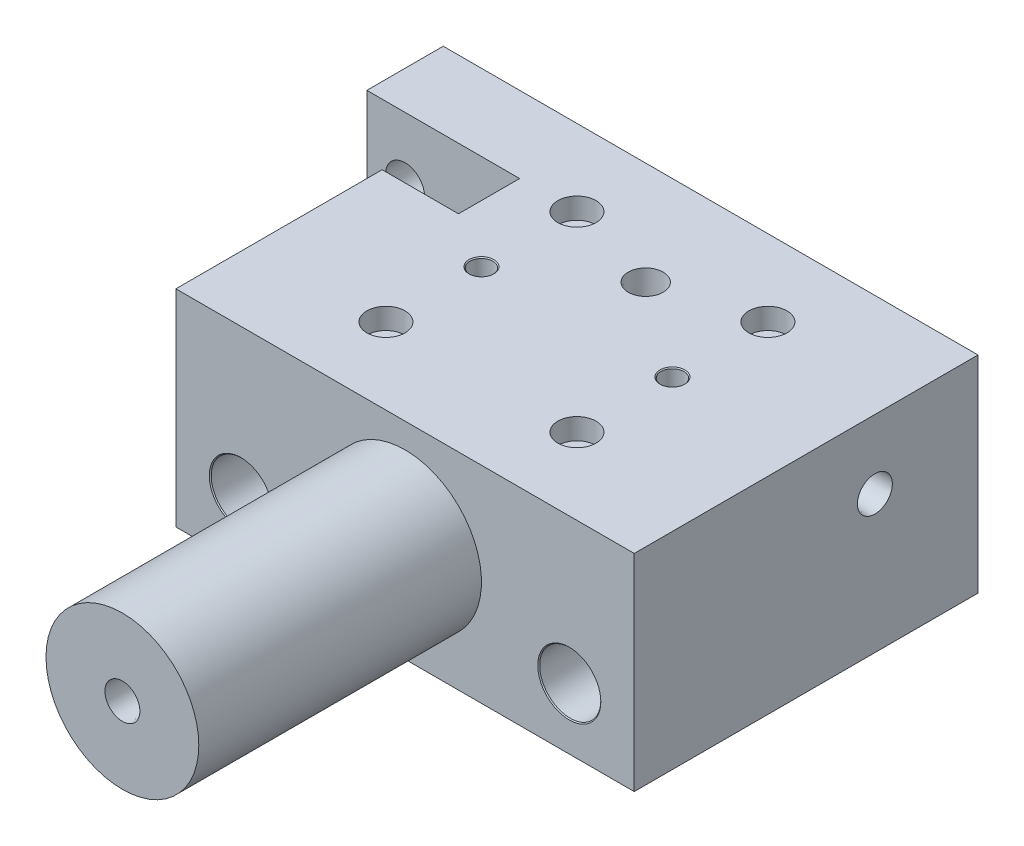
ISO-10303-21;
HEADER;
FILE_DESCRIPTION(('STEP AP214'),'2;1');
FILE_NAME('part.step','',(''),(''),'','','');
FILE_SCHEMA(('AUTOMOTIVE_DESIGN { 1 0 10303 214 1 1 1 1 }'));
ENDSEC;
DATA;
#1=APPLICATION_CONTEXT('core data for automotive mechanical design processes');
#2=APPLICATION_PROTOCOL_DEFINITION('international standard','automotive_design',2000,#1);
#3=PRODUCT_CONTEXT('',#1,'mechanical');
#4=PRODUCT('Part','Part','',(#3));
#5=PRODUCT_RELATED_PRODUCT_CATEGORY('part','',(#4));
#6=PRODUCT_DEFINITION_FORMATION('','',#4);
#7=PRODUCT_DEFINITION_CONTEXT('part definition',#1,'design');
#8=PRODUCT_DEFINITION('design','',#6,#7);
#9=PRODUCT_DEFINITION_SHAPE('','',#8);
#10=(LENGTH_UNIT() NAMED_UNIT(*) SI_UNIT(.MILLI.,.METRE.));
#11=(NAMED_UNIT(*) PLANE_ANGLE_UNIT() SI_UNIT($,.RADIAN.));
#12=(NAMED_UNIT(*) SI_UNIT($,.STERADIAN.) SOLID_ANGLE_UNIT());
#13=UNCERTAINTY_MEASURE_WITH_UNIT(LENGTH_MEASURE(1.E-05),#10,'distance_accuracy_value','');
#14=(GEOMETRIC_REPRESENTATION_CONTEXT(3) GLOBAL_UNCERTAINTY_ASSIGNED_CONTEXT((#13)) GLOBAL_UNIT_ASSIGNED_CONTEXT((#10,
#11,#12)) REPRESENTATION_CONTEXT('',''));
#15=CARTESIAN_POINT('',(0.,0.,0.));
#16=DIRECTION('',(0.,0.,1.));
#17=DIRECTION('',(1.,0.,0.));
#18=AXIS2_PLACEMENT_3D('',#15,#16,#17);
#19=CARTESIAN_POINT('',(0.,4.,-81.));
#20=DIRECTION('',(-1.,0.,0.));
#21=DIRECTION('',(0.,0.,1.));
#22=AXIS2_PLACEMENT_3D('',#19,#20,#21);
#23=CYLINDRICAL_SURFACE('',#22,2.39999999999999);
#24=CARTESIAN_POINT('',(8.99999999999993,4.,-81.));
#25=DIRECTION('',(-1.,0.,0.));
#26=DIRECTION('',(0.,0.,1.));
#27=AXIS2_PLACEMENT_3D('',#24,#25,#26);
#28=CIRCLE('',#27,2.39999999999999);
#29=CARTESIAN_POINT('',(8.99999999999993,4.,-78.6));
#30=VERTEX_POINT('',#29);
#31=EDGE_CURVE('E9355',#30,#30,#28,.T.);
#32=ORIENTED_EDGE('',*,*,#31,.F.);
#33=EDGE_LOOP('',(#32));
#34=FACE_BOUND('',#33,.T.);
#35=CARTESIAN_POINT('',(4.5,4.,-81.));
#36=DIRECTION('',(-1.,0.,0.));
#37=DIRECTION('',(0.,0.,1.));
#38=AXIS2_PLACEMENT_3D('',#35,#36,#37);
#39=CIRCLE('',#38,2.39999999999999);
#40=CARTESIAN_POINT('',(4.5,4.,-78.6));
#41=VERTEX_POINT('',#40);
#42=EDGE_CURVE('E9342',#41,#41,#39,.F.);
#43=ORIENTED_EDGE('',*,*,#42,.F.);
#44=EDGE_LOOP('',(#43));
#45=FACE_BOUND('',#44,.T.);
#46=ADVANCED_FACE('F9174',(#34,#45),#23,.F.);
#47=CARTESIAN_POINT('',(0.,54.,-90.));
#48=DIRECTION('',(1.,0.,0.));
#49=DIRECTION('',(0.,0.,-1.));
#50=AXIS2_PLACEMENT_3D('',#47,#48,#49);
#51=PLANE('',#50);
#52=CARTESIAN_POINT('',(0.,4.,-81.));
#53=DIRECTION('',(-1.,0.,0.));
#54=DIRECTION('',(0.,0.,1.));
#55=AXIS2_PLACEMENT_3D('',#52,#53,#54);
#56=CIRCLE('',#55,4.00000000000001);
#57=CARTESIAN_POINT('',(0.,3.85832158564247,-77.0025098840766));
#58=VERTEX_POINT('',#57);
#59=CARTESIAN_POINT('',(0.,4.,-85.));
#60=VERTEX_POINT('',#59);
#61=EDGE_CURVE('E9321',#58,#60,#56,.T.);
#62=ORIENTED_EDGE('',*,*,#61,.F.);
#63=DIRECTION('',(0.,1.,0.));
#64=VECTOR('',#63,1.);
#65=CARTESIAN_POINT('',(0.,3.85832158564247,-77.0025098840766));
#66=LINE('',#65,#64);
#67=CARTESIAN_POINT('',(0.,0.,-77.0025098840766));
#68=VERTEX_POINT('',#67);
#69=EDGE_CURVE('E9328',#68,#58,#66,.T.);
#70=ORIENTED_EDGE('',*,*,#69,.F.);
#71=DIRECTION('',(0.,0.,1.));
#72=VECTOR('',#71,1.);
#73=CARTESIAN_POINT('',(0.,0.,-90.));
#74=LINE('',#73,#72);
#75=CARTESIAN_POINT('',(0.,0.,-70.));
#76=VERTEX_POINT('',#75);
#77=EDGE_CURVE('E9548',#68,#76,#74,.T.);
#78=ORIENTED_EDGE('',*,*,#77,.T.);
#79=DIRECTION('',(0.,-1.,0.));
#80=VECTOR('',#79,1.);
#81=CARTESIAN_POINT('',(0.,54.,-70.));
#82=LINE('',#81,#80);
#83=CARTESIAN_POINT('',(0.,54.,-70.));
#84=VERTEX_POINT('',#83);
#85=EDGE_CURVE('E9580',#84,#76,#82,.T.);
#86=ORIENTED_EDGE('',*,*,#85,.F.);
#87=DIRECTION('',(0.,0.,1.));
#88=VECTOR('',#87,1.);
#89=CARTESIAN_POINT('',(0.,54.,-90.));
#90=LINE('',#89,#88);
#91=CARTESIAN_POINT('',(0.,54.,-90.));
#92=VERTEX_POINT('',#91);
#93=EDGE_CURVE('E9565',#92,#84,#90,.T.);
#94=ORIENTED_EDGE('',*,*,#93,.F.);
#95=DIRECTION('',(0.,-1.,0.));
#96=VECTOR('',#95,1.);
#97=CARTESIAN_POINT('',(0.,54.,-90.));
#98=LINE('',#97,#96);
#99=CARTESIAN_POINT('',(0.,0.,-90.));
#100=VERTEX_POINT('',#99);
#101=EDGE_CURVE('E9583',#92,#100,#98,.T.);
#102=ORIENTED_EDGE('',*,*,#101,.T.);
#103=CARTESIAN_POINT('',(0.,0.,-85.));
#104=VERTEX_POINT('',#103);
#105=EDGE_CURVE('E9549',#100,#104,#74,.T.);
#106=ORIENTED_EDGE('',*,*,#105,.T.);
#107=DIRECTION('',(0.,-1.,0.));
#108=VECTOR('',#107,1.);
#109=CARTESIAN_POINT('',(0.,4.,-85.));
#110=LINE('',#109,#108);
#111=EDGE_CURVE('E9326',#60,#104,#110,.T.);
#112=ORIENTED_EDGE('',*,*,#111,.F.);
#113=EDGE_LOOP('',(#62,#70,#78,#86,#94,#102,#106,#112));
#114=FACE_BOUND('',#113,.T.);
#115=ADVANCED_FACE('F9645',(#114),#51,.F.);
#116=CARTESIAN_POINT('',(140.,0.,-90.));
#117=DIRECTION('',(0.,-1.,0.));
#118=DIRECTION('',(0.,0.,-1.));
#119=AXIS2_PLACEMENT_3D('',#116,#117,#118);
#120=PLANE('',#119);
#121=DIRECTION('',(-1.,0.,0.));
#122=VECTOR('',#121,1.);
#123=CARTESIAN_POINT('',(4.5,0.,-77.0025098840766));
#124=LINE('',#123,#122);
#125=CARTESIAN_POINT('',(4.5,0.,-77.0025098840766));
#126=VERTEX_POINT('',#125);
#127=EDGE_CURVE('E9343',#126,#68,#124,.T.);
#128=ORIENTED_EDGE('',*,*,#127,.F.);
#129=DIRECTION('',(0.,0.,1.));
#130=VECTOR('',#129,1.);
#131=CARTESIAN_POINT('',(4.5,0.,-85.));
#132=LINE('',#131,#130);
#133=CARTESIAN_POINT('',(4.5,0.,-85.));
#134=VERTEX_POINT('',#133);
#135=EDGE_CURVE('E9334',#134,#126,#132,.T.);
#136=ORIENTED_EDGE('',*,*,#135,.F.);
#137=DIRECTION('',(-1.,0.,0.));
#138=VECTOR('',#137,1.);
#139=CARTESIAN_POINT('',(4.5,0.,-85.));
#140=LINE('',#139,#138);
#141=EDGE_CURVE('E9345',#134,#104,#140,.T.);
#142=ORIENTED_EDGE('',*,*,#141,.T.);
#143=ORIENTED_EDGE('',*,*,#105,.F.);
#144=DIRECTION('',(-1.,0.,0.));
#145=VECTOR('',#144,1.);
#146=CARTESIAN_POINT('',(0.,0.,-90.));
#147=LINE('',#146,#145);
#148=CARTESIAN_POINT('',(8.99999999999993,0.,-90.));
#149=VERTEX_POINT('',#148);
#150=EDGE_CURVE('E9544',#149,#100,#147,.T.);
#151=ORIENTED_EDGE('',*,*,#150,.F.);
#152=DIRECTION('',(0.,0.,-1.));
#153=VECTOR('',#152,1.);
#154=CARTESIAN_POINT('',(8.99999999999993,0.,-69.));
#155=LINE('',#154,#153);
#156=CARTESIAN_POINT('',(8.99999999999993,0.,-70.));
#157=VERTEX_POINT('',#156);
#158=EDGE_CURVE('E9358',#157,#149,#155,.T.);
#159=ORIENTED_EDGE('',*,*,#158,.F.);
#160=DIRECTION('',(1.,0.,0.));
#161=VECTOR('',#160,1.);
#162=CARTESIAN_POINT('',(0.,0.,-70.));
#163=LINE('',#162,#161);
#164=EDGE_CURVE('E9553',#76,#157,#163,.T.);
#165=ORIENTED_EDGE('',*,*,#164,.F.);
#166=ORIENTED_EDGE('',*,*,#77,.F.);
#167=EDGE_LOOP('',(#128,#136,#142,#143,#151,#159,#165,#166));
#168=FACE_BOUND('',#167,.T.);
#169=ADVANCED_FACE('F9652',(#168),#120,.T.);
#170=CARTESIAN_POINT('',(20.,54.,0.));
#171=DIRECTION('',(0.,0.,-1.));
#172=DIRECTION('',(-1.,0.,0.));
#173=AXIS2_PLACEMENT_3D('',#170,#171,#172);
#174=PLANE('',#173);
#175=DIRECTION('',(1.,0.,0.));
#176=VECTOR('',#175,1.);
#177=CARTESIAN_POINT('',(20.,0.,0.));
#178=LINE('',#177,#176);
#179=CARTESIAN_POINT('',(20.,0.,0.));
#180=VERTEX_POINT('',#179);
#181=CARTESIAN_POINT('',(140.,0.,0.));
#182=VERTEX_POINT('',#181);
#183=EDGE_CURVE('E9558',#180,#182,#178,.T.);
#184=ORIENTED_EDGE('',*,*,#183,.T.);
#185=DIRECTION('',(0.,-1.,0.));
#186=VECTOR('',#185,1.);
#187=CARTESIAN_POINT('',(140.,54.,0.));
#188=LINE('',#187,#186);
#189=CARTESIAN_POINT('',(140.,54.,0.));
#190=VERTEX_POINT('',#189);
#191=EDGE_CURVE('E9572',#190,#182,#188,.T.);
#192=ORIENTED_EDGE('',*,*,#191,.F.);
#193=DIRECTION('',(1.,0.,0.));
#194=VECTOR('',#193,1.);
#195=CARTESIAN_POINT('',(20.,54.,0.));
#196=LINE('',#195,#194);
#197=CARTESIAN_POINT('',(20.,54.,0.));
#198=VERTEX_POINT('',#197);
#199=EDGE_CURVE('E9570',#198,#190,#196,.T.);
#200=ORIENTED_EDGE('',*,*,#199,.F.);
#201=DIRECTION('',(0.,-1.,0.));
#202=VECTOR('',#201,1.);
#203=CARTESIAN_POINT('',(20.,54.,0.));
#204=LINE('',#203,#202);
#205=EDGE_CURVE('E9575',#198,#180,#204,.T.);
#206=ORIENTED_EDGE('',*,*,#205,.T.);
#207=EDGE_LOOP('',(#184,#192,#200,#206));
#208=FACE_BOUND('',#207,.T.);
#209=CARTESIAN_POINT('',(37.,16.,0.));
#210=DIRECTION('',(0.,0.,1.));
#211=DIRECTION('',(1.,0.,0.));
#212=AXIS2_PLACEMENT_3D('',#209,#210,#211);
#213=CIRCLE('',#212,8.25);
#214=CARTESIAN_POINT('',(45.25,16.,0.));
#215=VERTEX_POINT('',#214);
#216=EDGE_CURVE('E9526',#215,#215,#213,.T.);
#217=ORIENTED_EDGE('',*,*,#216,.F.);
#218=EDGE_LOOP('',(#217));
#219=FACE_BOUND('',#218,.T.);
#220=CARTESIAN_POINT('',(123.,16.,0.));
#221=DIRECTION('',(0.,0.,1.));
#222=DIRECTION('',(1.,0.,0.));
#223=AXIS2_PLACEMENT_3D('',#220,#221,#222);
#224=CIRCLE('',#223,8.24999999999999);
#225=CARTESIAN_POINT('',(131.25,16.,0.));
#226=VERTEX_POINT('',#225);
#227=EDGE_CURVE('E9514',#226,#226,#224,.T.);
#228=ORIENTED_EDGE('',*,*,#227,.F.);
#229=EDGE_LOOP('',(#228));
#230=FACE_BOUND('',#229,.T.);
#231=CARTESIAN_POINT('',(80.,27.5,0.));
#232=DIRECTION('',(0.,0.,-1.));
#233=DIRECTION('',(-1.,0.,0.));
#234=AXIS2_PLACEMENT_3D('',#231,#232,#233);
#235=CIRCLE('',#234,20.);
#236=CARTESIAN_POINT('',(60.,27.5,0.));
#237=VERTEX_POINT('',#236);
#238=EDGE_CURVE('E9589',#237,#237,#235,.F.);
#239=ORIENTED_EDGE('',*,*,#238,.F.);
#240=EDGE_LOOP('',(#239));
#241=FACE_BOUND('',#240,.T.);
#242=ADVANCED_FACE('F9626',(#208,#219,#230,#241),#174,.F.);
#243=DIRECTION('',(0.,0.,1.));
#244=VECTOR('',#243,1.);
#245=CARTESIAN_POINT('',(10.9999999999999,0.,-69.));
#246=LINE('',#245,#244);
#247=CARTESIAN_POINT('',(10.9999999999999,0.,-90.));
#248=VERTEX_POINT('',#247);
#249=CARTESIAN_POINT('',(10.9999999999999,0.,-70.));
#250=VERTEX_POINT('',#249);
#251=EDGE_CURVE('E9360',#248,#250,#246,.T.);
#252=ORIENTED_EDGE('',*,*,#251,.F.);
#253=CARTESIAN_POINT('',(140.,0.,-90.));
#254=VERTEX_POINT('',#253);
#255=EDGE_CURVE('E9545',#254,#248,#147,.T.);
#256=ORIENTED_EDGE('',*,*,#255,.F.);
#257=DIRECTION('',(0.,0.,-1.));
#258=VECTOR('',#257,1.);
#259=CARTESIAN_POINT('',(140.,0.,0.));
#260=LINE('',#259,#258);
#261=EDGE_CURVE('E9541',#182,#254,#260,.T.);
#262=ORIENTED_EDGE('',*,*,#261,.F.);
#263=ORIENTED_EDGE('',*,*,#183,.F.);
#264=DIRECTION('',(0.,0.,1.));
#265=VECTOR('',#264,1.);
#266=CARTESIAN_POINT('',(19.9999999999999,0.,-70.));
#267=LINE('',#266,#265);
#268=CARTESIAN_POINT('',(19.9999999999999,0.,-70.));
#269=VERTEX_POINT('',#268);
#270=EDGE_CURVE('E9556',#269,#180,#267,.T.);
#271=ORIENTED_EDGE('',*,*,#270,.F.);
#272=EDGE_CURVE('E9552',#250,#269,#163,.T.);
#273=ORIENTED_EDGE('',*,*,#272,.F.);
#274=EDGE_LOOP('',(#252,#256,#262,#263,#271,#273));
#275=FACE_BOUND('',#274,.T.);
#276=CARTESIAN_POINT('',(80.,0.,-63.));
#277=DIRECTION('',(0.,-1.,0.));
#278=DIRECTION('',(0.,0.,-1.));
#279=AXIS2_PLACEMENT_3D('',#276,#277,#278);
#280=CIRCLE('',#279,4.57349999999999);
#281=CARTESIAN_POINT('',(80.,0.,-67.5735));
#282=VERTEX_POINT('',#281);
#283=EDGE_CURVE('E9422',#282,#282,#280,.T.);
#284=ORIENTED_EDGE('',*,*,#283,.F.);
#285=EDGE_LOOP('',(#284));
#286=FACE_BOUND('',#285,.T.);
#287=CARTESIAN_POINT('',(55.,0.,-20.));
#288=DIRECTION('',(0.,-1.,0.));
#289=DIRECTION('',(0.,0.,-1.));
#290=AXIS2_PLACEMENT_3D('',#287,#288,#289);
#291=CIRCLE('',#290,5.);
#292=CARTESIAN_POINT('',(55.,0.,-25.));
#293=VERTEX_POINT('',#292);
#294=EDGE_CURVE('E9425',#293,#293,#291,.T.);
#295=ORIENTED_EDGE('',*,*,#294,.F.);
#296=EDGE_LOOP('',(#295));
#297=FACE_BOUND('',#296,.T.);
#298=CARTESIAN_POINT('',(55.,0.,-70.));
#299=DIRECTION('',(0.,-1.,0.));
#300=DIRECTION('',(0.,0.,-1.));
#301=AXIS2_PLACEMENT_3D('',#298,#299,#300);
#302=CIRCLE('',#301,5.);
#303=CARTESIAN_POINT('',(55.,0.,-75.));
#304=VERTEX_POINT('',#303);
#305=EDGE_CURVE('E9453',#304,#304,#302,.T.);
#306=ORIENTED_EDGE('',*,*,#305,.F.);
#307=EDGE_LOOP('',(#306));
#308=FACE_BOUND('',#307,.T.);
#309=CARTESIAN_POINT('',(105.,0.,-45.));
#310=DIRECTION('',(0.,-1.,0.));
#311=DIRECTION('',(0.,0.,-1.));
#312=AXIS2_PLACEMENT_3D('',#309,#310,#311);
#313=CIRCLE('',#312,3.25);
#314=CARTESIAN_POINT('',(105.,0.,-48.25));
#315=VERTEX_POINT('',#314);
#316=EDGE_CURVE('E9490',#315,#315,#313,.T.);
#317=ORIENTED_EDGE('',*,*,#316,.F.);
#318=EDGE_LOOP('',(#317));
#319=FACE_BOUND('',#318,.T.);
#320=CARTESIAN_POINT('',(55.,0.,-45.));
#321=DIRECTION('',(0.,-1.,0.));
#322=DIRECTION('',(0.,0.,-1.));
#323=AXIS2_PLACEMENT_3D('',#320,#321,#322);
#324=CIRCLE('',#323,3.25);
#325=CARTESIAN_POINT('',(55.,0.,-48.25));
#326=VERTEX_POINT('',#325);
#327=EDGE_CURVE('E9502',#326,#326,#324,.T.);
#328=ORIENTED_EDGE('',*,*,#327,.F.);
#329=EDGE_LOOP('',(#328));
#330=FACE_BOUND('',#329,.T.);
#331=CARTESIAN_POINT('',(105.,0.,-70.));
#332=DIRECTION('',(0.,-1.,0.));
#333=DIRECTION('',(0.,0.,-1.));
#334=AXIS2_PLACEMENT_3D('',#331,#332,#333);
#335=CIRCLE('',#334,5.);
#336=CARTESIAN_POINT('',(105.,0.,-75.));
#337=VERTEX_POINT('',#336);
#338=EDGE_CURVE('E9467',#337,#337,#335,.T.);
#339=ORIENTED_EDGE('',*,*,#338,.F.);
#340=EDGE_LOOP('',(#339));
#341=FACE_BOUND('',#340,.T.);
#342=CARTESIAN_POINT('',(105.,0.,-20.));
#343=DIRECTION('',(0.,-1.,0.));
#344=DIRECTION('',(0.,0.,-1.));
#345=AXIS2_PLACEMENT_3D('',#342,#343,#344);
#346=CIRCLE('',#345,5.);
#347=CARTESIAN_POINT('',(105.,0.,-25.));
#348=VERTEX_POINT('',#347);
#349=EDGE_CURVE('E9439',#348,#348,#346,.T.);
#350=ORIENTED_EDGE('',*,*,#349,.F.);
#351=EDGE_LOOP('',(#350));
#352=FACE_BOUND('',#351,.T.);
#353=ADVANCED_FACE('F9631',(#275,#286,#297,#308,#319,#330,#341,#352),#120,.T.);
#354=CARTESIAN_POINT('',(140.,54.,0.));
#355=DIRECTION('',(-1.,0.,0.));
#356=DIRECTION('',(0.,0.,1.));
#357=AXIS2_PLACEMENT_3D('',#354,#355,#356);
#358=PLANE('',#357);
#359=CARTESIAN_POINT('',(140.,36.,-63.));
#360=DIRECTION('',(1.,0.,0.));
#361=DIRECTION('',(0.,0.,-1.));
#362=AXIS2_PLACEMENT_3D('',#359,#360,#361);
#363=CIRCLE('',#362,4.5735);
#364=CARTESIAN_POINT('',(140.,36.,-67.5735));
#365=VERTEX_POINT('',#364);
#366=EDGE_CURVE('E9398',#365,#365,#363,.T.);
#367=ORIENTED_EDGE('',*,*,#366,.F.);
#368=EDGE_LOOP('',(#367));
#369=FACE_BOUND('',#368,.T.);
#370=ORIENTED_EDGE('',*,*,#261,.T.);
#371=DIRECTION('',(0.,-1.,0.));
#372=VECTOR('',#371,1.);
#373=CARTESIAN_POINT('',(140.,54.,-90.));
#374=LINE('',#373,#372);
#375=CARTESIAN_POINT('',(140.,54.,-90.));
#376=VERTEX_POINT('',#375);
#377=EDGE_CURVE('E9586',#376,#254,#374,.T.);
#378=ORIENTED_EDGE('',*,*,#377,.F.);
#379=DIRECTION('',(0.,0.,-1.));
#380=VECTOR('',#379,1.);
#381=CARTESIAN_POINT('',(140.,54.,0.));
#382=LINE('',#381,#380);
#383=EDGE_CURVE('E9560',#190,#376,#382,.T.);
#384=ORIENTED_EDGE('',*,*,#383,.F.);
#385=ORIENTED_EDGE('',*,*,#191,.T.);
#386=EDGE_LOOP('',(#370,#378,#384,#385));
#387=FACE_BOUND('',#386,.T.);
#388=ADVANCED_FACE('F9176',(#369,#387),#358,.F.);
#389=CARTESIAN_POINT('',(0.,54.,-90.));
#390=DIRECTION('',(0.,0.,1.));
#391=DIRECTION('',(1.,0.,0.));
#392=AXIS2_PLACEMENT_3D('',#389,#390,#391);
#393=PLANE('',#392);
#394=CARTESIAN_POINT('',(123.,16.,-90.));
#395=DIRECTION('',(0.,0.,1.));
#396=DIRECTION('',(1.,0.,0.));
#397=AXIS2_PLACEMENT_3D('',#394,#395,#396);
#398=CIRCLE('',#397,8.24999999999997);
#399=CARTESIAN_POINT('',(131.25,16.,-90.));
#400=VERTEX_POINT('',#399);
#401=EDGE_CURVE('E9505',#400,#400,#398,.T.);
#402=ORIENTED_EDGE('',*,*,#401,.T.);
#403=EDGE_LOOP('',(#402));
#404=FACE_BOUND('',#403,.T.);
#405=CARTESIAN_POINT('',(37.,16.,-90.));
#406=DIRECTION('',(0.,0.,1.));
#407=DIRECTION('',(1.,0.,0.));
#408=AXIS2_PLACEMENT_3D('',#405,#406,#407);
#409=CIRCLE('',#408,8.24999999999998);
#410=CARTESIAN_POINT('',(45.25,16.,-90.));
#411=VERTEX_POINT('',#410);
#412=EDGE_CURVE('E9517',#411,#411,#409,.T.);
#413=ORIENTED_EDGE('',*,*,#412,.T.);
#414=EDGE_LOOP('',(#413));
#415=FACE_BOUND('',#414,.T.);
#416=CARTESIAN_POINT('',(9.99999999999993,37.5,-90.));
#417=DIRECTION('',(0.,0.,1.));
#418=DIRECTION('',(1.,0.,0.));
#419=AXIS2_PLACEMENT_3D('',#416,#417,#418);
#420=CIRCLE('',#419,5.1);
#421=CARTESIAN_POINT('',(15.0999999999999,37.5,-90.));
#422=VERTEX_POINT('',#421);
#423=EDGE_CURVE('E9529',#422,#422,#420,.T.);
#424=ORIENTED_EDGE('',*,*,#423,.T.);
#425=EDGE_LOOP('',(#424));
#426=FACE_BOUND('',#425,.T.);
#427=CARTESIAN_POINT('',(9.99999999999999,13.5,-90.));
#428=DIRECTION('',(0.,0.,1.));
#429=DIRECTION('',(1.,0.,0.));
#430=AXIS2_PLACEMENT_3D('',#427,#428,#429);
#431=CIRCLE('',#430,6.);
#432=CARTESIAN_POINT('',(10.9999999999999,7.58392021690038,-90.));
#433=VERTEX_POINT('',#432);
#434=CARTESIAN_POINT('',(8.99999999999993,7.5839202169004,-90.));
#435=VERTEX_POINT('',#434);
#436=EDGE_CURVE('E9535',#433,#435,#431,.T.);
#437=ORIENTED_EDGE('',*,*,#436,.T.);
#438=DIRECTION('',(0.,-1.,0.));
#439=VECTOR('',#438,1.);
#440=CARTESIAN_POINT('',(8.99999999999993,54.,-90.));
#441=LINE('',#440,#439);
#442=EDGE_CURVE('E9371',#435,#149,#441,.T.);
#443=ORIENTED_EDGE('',*,*,#442,.T.);
#444=ORIENTED_EDGE('',*,*,#150,.T.);
#445=ORIENTED_EDGE('',*,*,#101,.F.);
#446=DIRECTION('',(-1.,0.,0.));
#447=VECTOR('',#446,1.);
#448=CARTESIAN_POINT('',(0.,54.,-90.));
#449=LINE('',#448,#447);
#450=EDGE_CURVE('E9563',#376,#92,#449,.T.);
#451=ORIENTED_EDGE('',*,*,#450,.F.);
#452=ORIENTED_EDGE('',*,*,#377,.T.);
#453=ORIENTED_EDGE('',*,*,#255,.T.);
#454=DIRECTION('',(0.,1.,0.));
#455=VECTOR('',#454,1.);
#456=CARTESIAN_POINT('',(10.9999999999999,54.,-90.));
#457=LINE('',#456,#455);
#458=EDGE_CURVE('E9365',#248,#433,#457,.T.);
#459=ORIENTED_EDGE('',*,*,#458,.T.);
#460=EDGE_LOOP('',(#437,#443,#444,#445,#451,#452,#453,#459));
#461=FACE_BOUND('',#460,.T.);
#462=ADVANCED_FACE('F9640',(#404,#415,#426,#461),#393,.F.);
#463=CARTESIAN_POINT('',(0.,54.,-70.));
#464=DIRECTION('',(0.,0.,-1.));
#465=DIRECTION('',(-1.,0.,0.));
#466=AXIS2_PLACEMENT_3D('',#463,#464,#465);
#467=PLANE('',#466);
#468=CARTESIAN_POINT('',(9.99999999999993,37.5,-70.));
#469=DIRECTION('',(0.,0.,1.));
#470=DIRECTION('',(1.,0.,0.));
#471=AXIS2_PLACEMENT_3D('',#468,#469,#470);
#472=CIRCLE('',#471,5.1);
#473=CARTESIAN_POINT('',(15.0999999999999,37.5,-70.));
#474=VERTEX_POINT('',#473);
#475=EDGE_CURVE('E9532',#474,#474,#472,.T.);
#476=ORIENTED_EDGE('',*,*,#475,.F.);
#477=EDGE_LOOP('',(#476));
#478=FACE_BOUND('',#477,.T.);
#479=DIRECTION('',(0.,-1.,0.));
#480=VECTOR('',#479,1.);
#481=CARTESIAN_POINT('',(19.9999999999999,54.,-70.));
#482=LINE('',#481,#480);
#483=CARTESIAN_POINT('',(19.9999999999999,34.,-70.));
#484=VERTEX_POINT('',#483);
#485=EDGE_CURVE('E9578',#484,#269,#482,.T.);
#486=ORIENTED_EDGE('',*,*,#485,.F.);
#487=DIRECTION('',(-0.707106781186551,-0.707106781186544,0.));
#488=VECTOR('',#487,1.);
#489=CARTESIAN_POINT('',(19.9999999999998,34.,-70.));
#490=LINE('',#489,#488);
#491=CARTESIAN_POINT('',(39.9999999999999,54.,-70.));
#492=VERTEX_POINT('',#491);
#493=EDGE_CURVE('E9182',#484,#492,#490,.F.);
#494=ORIENTED_EDGE('',*,*,#493,.T.);
#495=DIRECTION('',(1.,0.,0.));
#496=VECTOR('',#495,1.);
#497=CARTESIAN_POINT('',(0.,54.,-70.));
#498=LINE('',#497,#496);
#499=EDGE_CURVE('E9311',#84,#492,#498,.T.);
#500=ORIENTED_EDGE('',*,*,#499,.F.);
#501=ORIENTED_EDGE('',*,*,#85,.T.);
#502=ORIENTED_EDGE('',*,*,#164,.T.);
#503=DIRECTION('',(0.,1.,0.));
#504=VECTOR('',#503,1.);
#505=CARTESIAN_POINT('',(8.99999999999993,54.,-70.));
#506=LINE('',#505,#504);
#507=CARTESIAN_POINT('',(8.99999999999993,7.5839202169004,-70.));
#508=VERTEX_POINT('',#507);
#509=EDGE_CURVE('E9368',#157,#508,#506,.T.);
#510=ORIENTED_EDGE('',*,*,#509,.T.);
#511=CARTESIAN_POINT('',(9.99999999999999,13.5,-70.));
#512=DIRECTION('',(0.,0.,1.));
#513=DIRECTION('',(1.,0.,0.));
#514=AXIS2_PLACEMENT_3D('',#511,#512,#513);
#515=CIRCLE('',#514,6.);
#516=CARTESIAN_POINT('',(10.9999999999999,7.58392021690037,-70.));
#517=VERTEX_POINT('',#516);
#518=EDGE_CURVE('E9538',#517,#508,#515,.T.);
#519=ORIENTED_EDGE('',*,*,#518,.F.);
#520=DIRECTION('',(0.,-1.,0.));
#521=VECTOR('',#520,1.);
#522=CARTESIAN_POINT('',(10.9999999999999,54.,-70.));
#523=LINE('',#522,#521);
#524=EDGE_CURVE('E9362',#517,#250,#523,.T.);
#525=ORIENTED_EDGE('',*,*,#524,.T.);
#526=ORIENTED_EDGE('',*,*,#272,.T.);
#527=EDGE_LOOP('',(#486,#494,#500,#501,#502,#510,#519,#525,#526));
#528=FACE_BOUND('',#527,.T.);
#529=ADVANCED_FACE('F9616',(#478,#528),#467,.F.);
#530=CARTESIAN_POINT('',(19.9999999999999,54.,-70.));
#531=DIRECTION('',(1.,0.,0.));
#532=DIRECTION('',(0.,0.,-1.));
#533=AXIS2_PLACEMENT_3D('',#530,#531,#532);
#534=PLANE('',#533);
#535=DIRECTION('',(0.,0.,1.));
#536=VECTOR('',#535,1.);
#537=CARTESIAN_POINT('',(19.9999999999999,54.,-70.));
#538=LINE('',#537,#536);
#539=CARTESIAN_POINT('',(19.9999999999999,54.,-54.));
#540=VERTEX_POINT('',#539);
#541=EDGE_CURVE('E9568',#540,#198,#538,.T.);
#542=ORIENTED_EDGE('',*,*,#541,.F.);
#543=DIRECTION('',(0.,1.,0.));
#544=VECTOR('',#543,1.);
#545=CARTESIAN_POINT('',(19.9999999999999,34.,-54.));
#546=LINE('',#545,#544);
#547=CARTESIAN_POINT('',(19.9999999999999,34.,-54.));
#548=VERTEX_POINT('',#547);
#549=EDGE_CURVE('E9188',#548,#540,#546,.T.);
#550=ORIENTED_EDGE('',*,*,#549,.F.);
#551=DIRECTION('',(0.,0.,1.));
#552=VECTOR('',#551,1.);
#553=CARTESIAN_POINT('',(19.9999999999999,34.,-54.));
#554=LINE('',#553,#552);
#555=EDGE_CURVE('E9313',#484,#548,#554,.T.);
#556=ORIENTED_EDGE('',*,*,#555,.F.);
#557=ORIENTED_EDGE('',*,*,#485,.T.);
#558=ORIENTED_EDGE('',*,*,#270,.T.);
#559=ORIENTED_EDGE('',*,*,#205,.F.);
#560=EDGE_LOOP('',(#542,#550,#556,#557,#558,#559));
#561=FACE_BOUND('',#560,.T.);
#562=ADVANCED_FACE('F9620',(#561),#534,.F.);
#563=CARTESIAN_POINT('',(140.,54.,-90.));
#564=DIRECTION('',(0.,-1.,0.));
#565=DIRECTION('',(0.,0.,-1.));
#566=AXIS2_PLACEMENT_3D('',#563,#564,#565);
#567=PLANE('',#566);
#568=CARTESIAN_POINT('',(80.,54.,-63.));
#569=DIRECTION('',(0.,1.,0.));
#570=DIRECTION('',(0.,0.,1.));
#571=AXIS2_PLACEMENT_3D('',#568,#569,#570);
#572=CIRCLE('',#571,4.57349999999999);
#573=CARTESIAN_POINT('',(80.,54.,-58.4265));
#574=VERTEX_POINT('',#573);
#575=EDGE_CURVE('E9401',#574,#574,#572,.T.);
#576=ORIENTED_EDGE('',*,*,#575,.F.);
#577=EDGE_LOOP('',(#576));
#578=FACE_BOUND('',#577,.T.);
#579=CARTESIAN_POINT('',(55.,54.,-20.));
#580=DIRECTION('',(0.,1.,0.));
#581=DIRECTION('',(0.,0.,1.));
#582=AXIS2_PLACEMENT_3D('',#579,#580,#581);
#583=CIRCLE('',#582,5.);
#584=CARTESIAN_POINT('',(55.,54.,-15.));
#585=VERTEX_POINT('',#584);
#586=EDGE_CURVE('E9432',#585,#585,#583,.T.);
#587=ORIENTED_EDGE('',*,*,#586,.F.);
#588=EDGE_LOOP('',(#587));
#589=FACE_BOUND('',#588,.T.);
#590=CARTESIAN_POINT('',(105.,54.,-20.));
#591=DIRECTION('',(0.,1.,0.));
#592=DIRECTION('',(0.,0.,1.));
#593=AXIS2_PLACEMENT_3D('',#590,#591,#592);
#594=CIRCLE('',#593,5.);
#595=CARTESIAN_POINT('',(105.,54.,-15.));
#596=VERTEX_POINT('',#595);
#597=EDGE_CURVE('E9446',#596,#596,#594,.T.);
#598=ORIENTED_EDGE('',*,*,#597,.F.);
#599=EDGE_LOOP('',(#598));
#600=FACE_BOUND('',#599,.T.);
#601=CARTESIAN_POINT('',(55.,54.,-70.));
#602=DIRECTION('',(0.,1.,0.));
#603=DIRECTION('',(0.,0.,1.));
#604=AXIS2_PLACEMENT_3D('',#601,#602,#603);
#605=CIRCLE('',#604,5.);
#606=CARTESIAN_POINT('',(55.,54.,-65.));
#607=VERTEX_POINT('',#606);
#608=EDGE_CURVE('E9460',#607,#607,#605,.T.);
#609=ORIENTED_EDGE('',*,*,#608,.F.);
#610=EDGE_LOOP('',(#609));
#611=FACE_BOUND('',#610,.T.);
#612=CARTESIAN_POINT('',(105.,54.,-70.));
#613=DIRECTION('',(0.,1.,0.));
#614=DIRECTION('',(0.,0.,1.));
#615=AXIS2_PLACEMENT_3D('',#612,#613,#614);
#616=CIRCLE('',#615,5.);
#617=CARTESIAN_POINT('',(105.,54.,-65.));
#618=VERTEX_POINT('',#617);
#619=EDGE_CURVE('E9477',#618,#618,#616,.T.);
#620=ORIENTED_EDGE('',*,*,#619,.F.);
#621=EDGE_LOOP('',(#620));
#622=FACE_BOUND('',#621,.T.);
#623=CARTESIAN_POINT('',(105.,54.,-45.));
#624=DIRECTION('',(0.,-1.,0.));
#625=DIRECTION('',(0.,0.,-1.));
#626=AXIS2_PLACEMENT_3D('',#623,#624,#625);
#627=CIRCLE('',#626,3.24999999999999);
#628=CARTESIAN_POINT('',(105.,54.,-48.25));
#629=VERTEX_POINT('',#628);
#630=EDGE_CURVE('E9481',#629,#629,#627,.T.);
#631=ORIENTED_EDGE('',*,*,#630,.T.);
#632=EDGE_LOOP('',(#631));
#633=FACE_BOUND('',#632,.T.);
#634=CARTESIAN_POINT('',(55.,54.,-45.));
#635=DIRECTION('',(0.,-1.,0.));
#636=DIRECTION('',(0.,0.,-1.));
#637=AXIS2_PLACEMENT_3D('',#634,#635,#636);
#638=CIRCLE('',#637,3.24999999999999);
#639=CARTESIAN_POINT('',(55.,54.,-48.25));
#640=VERTEX_POINT('',#639);
#641=EDGE_CURVE('E9493',#640,#640,#638,.T.);
#642=ORIENTED_EDGE('',*,*,#641,.T.);
#643=EDGE_LOOP('',(#642));
#644=FACE_BOUND('',#643,.T.);
#645=ORIENTED_EDGE('',*,*,#499,.T.);
#646=DIRECTION('',(0.,0.,-1.));
#647=VECTOR('',#646,1.);
#648=CARTESIAN_POINT('',(39.9999999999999,54.,-70.));
#649=LINE('',#648,#647);
#650=CARTESIAN_POINT('',(39.9999999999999,54.,-54.));
#651=VERTEX_POINT('',#650);
#652=EDGE_CURVE('E9305',#651,#492,#649,.T.);
#653=ORIENTED_EDGE('',*,*,#652,.F.);
#654=DIRECTION('',(1.,0.,0.));
#655=VECTOR('',#654,1.);
#656=CARTESIAN_POINT('',(39.9999999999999,54.,-54.));
#657=LINE('',#656,#655);
#658=EDGE_CURVE('E9299',#540,#651,#657,.T.);
#659=ORIENTED_EDGE('',*,*,#658,.F.);
#660=ORIENTED_EDGE('',*,*,#541,.T.);
#661=ORIENTED_EDGE('',*,*,#199,.T.);
#662=ORIENTED_EDGE('',*,*,#383,.T.);
#663=ORIENTED_EDGE('',*,*,#450,.T.);
#664=ORIENTED_EDGE('',*,*,#93,.T.);
#665=EDGE_LOOP('',(#645,#653,#659,#660,#661,#662,#663,#664));
#666=FACE_BOUND('',#665,.T.);
#667=ADVANCED_FACE('F9309',(#578,#589,#600,#611,#622,#633,#644,#666),#567,.F.);
#668=CARTESIAN_POINT('',(9.99999999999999,13.5,-70.));
#669=DIRECTION('',(0.,0.,1.));
#670=DIRECTION('',(1.,0.,0.));
#671=AXIS2_PLACEMENT_3D('',#668,#669,#670);
#672=CYLINDRICAL_SURFACE('',#671,6.);
#673=ORIENTED_EDGE('',*,*,#518,.T.);
#674=DIRECTION('',(0.,0.,1.));
#675=VECTOR('',#674,1.);
#676=CARTESIAN_POINT('',(8.99999999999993,7.5839202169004,-70.));
#677=LINE('',#676,#675);
#678=EDGE_CURVE('E9611',#508,#435,#677,.F.);
#679=ORIENTED_EDGE('',*,*,#678,.T.);
#680=ORIENTED_EDGE('',*,*,#436,.F.);
#681=DIRECTION('',(0.,0.,1.));
#682=VECTOR('',#681,1.);
#683=CARTESIAN_POINT('',(10.9999999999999,7.58392021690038,-70.));
#684=LINE('',#683,#682);
#685=EDGE_CURVE('E9608',#433,#517,#684,.T.);
#686=ORIENTED_EDGE('',*,*,#685,.T.);
#687=EDGE_LOOP('',(#673,#679,#680,#686));
#688=FACE_BOUND('',#687,.T.);
#689=ADVANCED_FACE('F9657',(#688),#672,.F.);
#690=CARTESIAN_POINT('',(9.99999999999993,37.5,-70.));
#691=DIRECTION('',(0.,0.,1.));
#692=DIRECTION('',(1.,0.,0.));
#693=AXIS2_PLACEMENT_3D('',#690,#691,#692);
#694=CYLINDRICAL_SURFACE('',#693,5.1);
#695=ORIENTED_EDGE('',*,*,#423,.F.);
#696=EDGE_LOOP('',(#695));
#697=FACE_BOUND('',#696,.T.);
#698=ORIENTED_EDGE('',*,*,#475,.T.);
#699=EDGE_LOOP('',(#698));
#700=FACE_BOUND('',#699,.T.);
#701=ADVANCED_FACE('F9789',(#697,#700),#694,.F.);
#702=CARTESIAN_POINT('',(37.,16.,0.));
#703=DIRECTION('',(0.,0.,1.));
#704=DIRECTION('',(1.,0.,0.));
#705=AXIS2_PLACEMENT_3D('',#702,#703,#704);
#706=CONICAL_SURFACE('',#705,8.25,0.785398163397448);
#707=CARTESIAN_POINT('',(37.,16.,-0.250000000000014));
#708=DIRECTION('',(0.,0.,1.));
#709=DIRECTION('',(1.,0.,0.));
#710=AXIS2_PLACEMENT_3D('',#707,#708,#709);
#711=CIRCLE('',#710,7.99999999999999);
#712=CARTESIAN_POINT('',(45.,16.,-0.250000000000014));
#713=VERTEX_POINT('',#712);
#714=EDGE_CURVE('E9523',#713,#713,#711,.T.);
#715=ORIENTED_EDGE('',*,*,#714,.F.);
#716=EDGE_LOOP('',(#715));
#717=FACE_BOUND('',#716,.T.);
#718=ORIENTED_EDGE('',*,*,#216,.T.);
#719=EDGE_LOOP('',(#718));
#720=FACE_BOUND('',#719,.T.);
#721=ADVANCED_FACE('F10199',(#717,#720),#706,.F.);
#722=CARTESIAN_POINT('',(37.,16.,0.));
#723=DIRECTION('',(0.,0.,1.));
#724=DIRECTION('',(1.,0.,0.));
#725=AXIS2_PLACEMENT_3D('',#722,#723,#724);
#726=CYLINDRICAL_SURFACE('',#725,7.99999999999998);
#727=CARTESIAN_POINT('',(37.,16.,-89.75));
#728=DIRECTION('',(0.,0.,1.));
#729=DIRECTION('',(1.,0.,0.));
#730=AXIS2_PLACEMENT_3D('',#727,#728,#729);
#731=CIRCLE('',#730,7.99999999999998);
#732=CARTESIAN_POINT('',(45.,16.,-89.75));
#733=VERTEX_POINT('',#732);
#734=EDGE_CURVE('E9520',#733,#733,#731,.T.);
#735=ORIENTED_EDGE('',*,*,#734,.F.);
#736=EDGE_LOOP('',(#735));
#737=FACE_BOUND('',#736,.T.);
#738=ORIENTED_EDGE('',*,*,#714,.T.);
#739=EDGE_LOOP('',(#738));
#740=FACE_BOUND('',#739,.T.);
#741=ADVANCED_FACE('F10191',(#737,#740),#726,.F.);
#742=CARTESIAN_POINT('',(37.,16.,-89.75));
#743=DIRECTION('',(0.,0.,-1.));
#744=DIRECTION('',(-1.,0.,0.));
#745=AXIS2_PLACEMENT_3D('',#742,#743,#744);
#746=CONICAL_SURFACE('',#745,7.99999999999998,0.785398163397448);
#747=ORIENTED_EDGE('',*,*,#412,.F.);
#748=EDGE_LOOP('',(#747));
#749=FACE_BOUND('',#748,.T.);
#750=ORIENTED_EDGE('',*,*,#734,.T.);
#751=EDGE_LOOP('',(#750));
#752=FACE_BOUND('',#751,.T.);
#753=ADVANCED_FACE('F10183',(#749,#752),#746,.F.);
#754=CARTESIAN_POINT('',(123.,16.,0.));
#755=DIRECTION('',(0.,0.,1.));
#756=DIRECTION('',(1.,0.,0.));
#757=AXIS2_PLACEMENT_3D('',#754,#755,#756);
#758=CONICAL_SURFACE('',#757,8.24999999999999,0.785398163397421);
#759=CARTESIAN_POINT('',(123.,16.,-0.250000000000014));
#760=DIRECTION('',(0.,0.,1.));
#761=DIRECTION('',(1.,0.,0.));
#762=AXIS2_PLACEMENT_3D('',#759,#760,#761);
#763=CIRCLE('',#762,7.99999999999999);
#764=CARTESIAN_POINT('',(131.,16.,-0.250000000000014));
#765=VERTEX_POINT('',#764);
#766=EDGE_CURVE('E9511',#765,#765,#763,.T.);
#767=ORIENTED_EDGE('',*,*,#766,.F.);
#768=EDGE_LOOP('',(#767));
#769=FACE_BOUND('',#768,.T.);
#770=ORIENTED_EDGE('',*,*,#227,.T.);
#771=EDGE_LOOP('',(#770));
#772=FACE_BOUND('',#771,.T.);
#773=ADVANCED_FACE('F10175',(#769,#772),#758,.F.);
#774=CARTESIAN_POINT('',(123.,16.,0.));
#775=DIRECTION('',(0.,0.,1.));
#776=DIRECTION('',(1.,0.,0.));
#777=AXIS2_PLACEMENT_3D('',#774,#775,#776);
#778=CYLINDRICAL_SURFACE('',#777,7.99999999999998);
#779=CARTESIAN_POINT('',(123.,16.,-89.75));
#780=DIRECTION('',(0.,0.,1.));
#781=DIRECTION('',(1.,0.,0.));
#782=AXIS2_PLACEMENT_3D('',#779,#780,#781);
#783=CIRCLE('',#782,7.99999999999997);
#784=CARTESIAN_POINT('',(131.,16.,-89.75));
#785=VERTEX_POINT('',#784);
#786=EDGE_CURVE('E9508',#785,#785,#783,.T.);
#787=ORIENTED_EDGE('',*,*,#786,.F.);
#788=EDGE_LOOP('',(#787));
#789=FACE_BOUND('',#788,.T.);
#790=ORIENTED_EDGE('',*,*,#766,.T.);
#791=EDGE_LOOP('',(#790));
#792=FACE_BOUND('',#791,.T.);
#793=ADVANCED_FACE('F10167',(#789,#792),#778,.F.);
#794=CARTESIAN_POINT('',(123.,16.,-89.75));
#795=DIRECTION('',(0.,0.,-1.));
#796=DIRECTION('',(-1.,0.,0.));
#797=AXIS2_PLACEMENT_3D('',#794,#795,#796);
#798=CONICAL_SURFACE('',#797,7.99999999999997,0.785398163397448);
#799=ORIENTED_EDGE('',*,*,#401,.F.);
#800=EDGE_LOOP('',(#799));
#801=FACE_BOUND('',#800,.T.);
#802=ORIENTED_EDGE('',*,*,#786,.T.);
#803=EDGE_LOOP('',(#802));
#804=FACE_BOUND('',#803,.T.);
#805=ADVANCED_FACE('F10159',(#801,#804),#798,.F.);
#806=CARTESIAN_POINT('',(55.,0.,-45.));
#807=DIRECTION('',(0.,-1.,0.));
#808=DIRECTION('',(0.,0.,-1.));
#809=AXIS2_PLACEMENT_3D('',#806,#807,#808);
#810=CONICAL_SURFACE('',#809,3.25,0.785398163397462);
#811=CARTESIAN_POINT('',(55.,0.25,-45.));
#812=DIRECTION('',(0.,-1.,0.));
#813=DIRECTION('',(0.,0.,-1.));
#814=AXIS2_PLACEMENT_3D('',#811,#812,#813);
#815=CIRCLE('',#814,3.);
#816=CARTESIAN_POINT('',(55.,0.25,-48.));
#817=VERTEX_POINT('',#816);
#818=EDGE_CURVE('E9499',#817,#817,#815,.T.);
#819=ORIENTED_EDGE('',*,*,#818,.F.);
#820=EDGE_LOOP('',(#819));
#821=FACE_BOUND('',#820,.T.);
#822=ORIENTED_EDGE('',*,*,#327,.T.);
#823=EDGE_LOOP('',(#822));
#824=FACE_BOUND('',#823,.T.);
#825=ADVANCED_FACE('F10151',(#821,#824),#810,.F.);
#826=CARTESIAN_POINT('',(55.,0.,-45.));
#827=DIRECTION('',(0.,-1.,0.));
#828=DIRECTION('',(0.,0.,-1.));
#829=AXIS2_PLACEMENT_3D('',#826,#827,#828);
#830=CYLINDRICAL_SURFACE('',#829,2.99999999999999);
#831=CARTESIAN_POINT('',(55.,53.75,-45.));
#832=DIRECTION('',(0.,-1.,0.));
#833=DIRECTION('',(0.,0.,-1.));
#834=AXIS2_PLACEMENT_3D('',#831,#832,#833);
#835=CIRCLE('',#834,2.99999999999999);
#836=CARTESIAN_POINT('',(55.,53.75,-48.));
#837=VERTEX_POINT('',#836);
#838=EDGE_CURVE('E9496',#837,#837,#835,.T.);
#839=ORIENTED_EDGE('',*,*,#838,.F.);
#840=EDGE_LOOP('',(#839));
#841=FACE_BOUND('',#840,.T.);
#842=ORIENTED_EDGE('',*,*,#818,.T.);
#843=EDGE_LOOP('',(#842));
#844=FACE_BOUND('',#843,.T.);
#845=ADVANCED_FACE('F10143',(#841,#844),#830,.F.);
#846=CARTESIAN_POINT('',(55.,53.75,-45.));
#847=DIRECTION('',(0.,1.,0.));
#848=DIRECTION('',(0.,0.,1.));
#849=AXIS2_PLACEMENT_3D('',#846,#847,#848);
#850=CONICAL_SURFACE('',#849,2.99999999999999,0.785398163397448);
#851=ORIENTED_EDGE('',*,*,#641,.F.);
#852=EDGE_LOOP('',(#851));
#853=FACE_BOUND('',#852,.T.);
#854=ORIENTED_EDGE('',*,*,#838,.T.);
#855=EDGE_LOOP('',(#854));
#856=FACE_BOUND('',#855,.T.);
#857=ADVANCED_FACE('F10135',(#853,#856),#850,.F.);
#858=CARTESIAN_POINT('',(105.,0.,-45.));
#859=DIRECTION('',(0.,-1.,0.));
#860=DIRECTION('',(0.,0.,-1.));
#861=AXIS2_PLACEMENT_3D('',#858,#859,#860);
#862=CONICAL_SURFACE('',#861,3.25,0.785398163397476);
#863=CARTESIAN_POINT('',(105.,0.25,-45.));
#864=DIRECTION('',(0.,-1.,0.));
#865=DIRECTION('',(0.,0.,-1.));
#866=AXIS2_PLACEMENT_3D('',#863,#864,#865);
#867=CIRCLE('',#866,2.99999999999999);
#868=CARTESIAN_POINT('',(105.,0.25,-48.));
#869=VERTEX_POINT('',#868);
#870=EDGE_CURVE('E9487',#869,#869,#867,.T.);
#871=ORIENTED_EDGE('',*,*,#870,.F.);
#872=EDGE_LOOP('',(#871));
#873=FACE_BOUND('',#872,.T.);
#874=ORIENTED_EDGE('',*,*,#316,.T.);
#875=EDGE_LOOP('',(#874));
#876=FACE_BOUND('',#875,.T.);
#877=ADVANCED_FACE('F10127',(#873,#876),#862,.F.);
#878=CARTESIAN_POINT('',(105.,0.,-45.));
#879=DIRECTION('',(0.,-1.,0.));
#880=DIRECTION('',(0.,0.,-1.));
#881=AXIS2_PLACEMENT_3D('',#878,#879,#880);
#882=CYLINDRICAL_SURFACE('',#881,2.99999999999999);
#883=CARTESIAN_POINT('',(105.,53.75,-45.));
#884=DIRECTION('',(0.,-1.,0.));
#885=DIRECTION('',(0.,0.,-1.));
#886=AXIS2_PLACEMENT_3D('',#883,#884,#885);
#887=CIRCLE('',#886,2.99999999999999);
#888=CARTESIAN_POINT('',(105.,53.75,-48.));
#889=VERTEX_POINT('',#888);
#890=EDGE_CURVE('E9484',#889,#889,#887,.T.);
#891=ORIENTED_EDGE('',*,*,#890,.F.);
#892=EDGE_LOOP('',(#891));
#893=FACE_BOUND('',#892,.T.);
#894=ORIENTED_EDGE('',*,*,#870,.T.);
#895=EDGE_LOOP('',(#894));
#896=FACE_BOUND('',#895,.T.);
#897=ADVANCED_FACE('F10119',(#893,#896),#882,.F.);
#898=CARTESIAN_POINT('',(105.,53.75,-45.));
#899=DIRECTION('',(0.,1.,0.));
#900=DIRECTION('',(0.,0.,1.));
#901=AXIS2_PLACEMENT_3D('',#898,#899,#900);
#902=CONICAL_SURFACE('',#901,2.99999999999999,0.785398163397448);
#903=ORIENTED_EDGE('',*,*,#630,.F.);
#904=EDGE_LOOP('',(#903));
#905=FACE_BOUND('',#904,.T.);
#906=ORIENTED_EDGE('',*,*,#890,.T.);
#907=EDGE_LOOP('',(#906));
#908=FACE_BOUND('',#907,.T.);
#909=ADVANCED_FACE('F10098',(#905,#908),#902,.F.);
#910=CARTESIAN_POINT('',(105.,54.,-70.));
#911=DIRECTION('',(0.,1.,0.));
#912=DIRECTION('',(0.,0.,1.));
#913=AXIS2_PLACEMENT_3D('',#910,#911,#912);
#914=CYLINDRICAL_SURFACE('',#913,2.49999999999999);
#915=CARTESIAN_POINT('',(105.,5.50000000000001,-70.));
#916=DIRECTION('',(0.,1.,0.));
#917=DIRECTION('',(0.,0.,1.));
#918=AXIS2_PLACEMENT_3D('',#915,#916,#917);
#919=CIRCLE('',#918,2.49999999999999);
#920=CARTESIAN_POINT('',(105.,5.50000000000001,-67.5));
#921=VERTEX_POINT('',#920);
#922=EDGE_CURVE('E9473',#921,#921,#919,.F.);
#923=ORIENTED_EDGE('',*,*,#922,.T.);
#924=EDGE_LOOP('',(#923));
#925=FACE_BOUND('',#924,.T.);
#926=CARTESIAN_POINT('',(105.,48.5,-70.));
#927=DIRECTION('',(0.,-1.,0.));
#928=DIRECTION('',(0.,0.,-1.));
#929=AXIS2_PLACEMENT_3D('',#926,#927,#928);
#930=CIRCLE('',#929,2.49999999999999);
#931=CARTESIAN_POINT('',(105.,48.5,-72.5));
#932=VERTEX_POINT('',#931);
#933=EDGE_CURVE('E9480',#932,#932,#930,.F.);
#934=ORIENTED_EDGE('',*,*,#933,.T.);
#935=EDGE_LOOP('',(#934));
#936=FACE_BOUND('',#935,.T.);
#937=ADVANCED_FACE('F10093',(#925,#936),#914,.F.);
#938=CARTESIAN_POINT('',(105.,48.5,-70.));
#939=DIRECTION('',(0.,-1.,0.));
#940=DIRECTION('',(0.,0.,-1.));
#941=AXIS2_PLACEMENT_3D('',#938,#939,#940);
#942=PLANE('',#941);
#943=CARTESIAN_POINT('',(105.,48.5,-70.));
#944=DIRECTION('',(0.,1.,0.));
#945=DIRECTION('',(0.,0.,1.));
#946=AXIS2_PLACEMENT_3D('',#943,#944,#945);
#947=CIRCLE('',#946,5.);
#948=CARTESIAN_POINT('',(105.,48.5,-65.));
#949=VERTEX_POINT('',#948);
#950=EDGE_CURVE('E9474',#949,#949,#947,.T.);
#951=ORIENTED_EDGE('',*,*,#950,.T.);
#952=EDGE_LOOP('',(#951));
#953=FACE_BOUND('',#952,.T.);
#954=ORIENTED_EDGE('',*,*,#933,.F.);
#955=EDGE_LOOP('',(#954));
#956=FACE_BOUND('',#955,.T.);
#957=ADVANCED_FACE('F10097',(#953,#956),#942,.F.);
#958=CARTESIAN_POINT('',(105.,54.,-70.));
#959=DIRECTION('',(0.,1.,0.));
#960=DIRECTION('',(0.,0.,1.));
#961=AXIS2_PLACEMENT_3D('',#958,#959,#960);
#962=CYLINDRICAL_SURFACE('',#961,5.);
#963=ORIENTED_EDGE('',*,*,#950,.F.);
#964=EDGE_LOOP('',(#963));
#965=FACE_BOUND('',#964,.T.);
#966=ORIENTED_EDGE('',*,*,#619,.T.);
#967=EDGE_LOOP('',(#966));
#968=FACE_BOUND('',#967,.T.);
#969=ADVANCED_FACE('F10087',(#965,#968),#962,.F.);
#970=CARTESIAN_POINT('',(105.,5.5,-70.));
#971=DIRECTION('',(0.,1.,0.));
#972=DIRECTION('',(0.,0.,1.));
#973=AXIS2_PLACEMENT_3D('',#970,#971,#972);
#974=PLANE('',#973);
#975=CARTESIAN_POINT('',(105.,5.5,-70.));
#976=DIRECTION('',(0.,-1.,0.));
#977=DIRECTION('',(0.,0.,-1.));
#978=AXIS2_PLACEMENT_3D('',#975,#976,#977);
#979=CIRCLE('',#978,5.);
#980=CARTESIAN_POINT('',(105.,5.5,-75.));
#981=VERTEX_POINT('',#980);
#982=EDGE_CURVE('E9470',#981,#981,#979,.T.);
#983=ORIENTED_EDGE('',*,*,#982,.T.);
#984=EDGE_LOOP('',(#983));
#985=FACE_BOUND('',#984,.T.);
#986=ORIENTED_EDGE('',*,*,#922,.F.);
#987=EDGE_LOOP('',(#986));
#988=FACE_BOUND('',#987,.T.);
#989=ADVANCED_FACE('F10079',(#985,#988),#974,.F.);
#990=CARTESIAN_POINT('',(105.,0.,-70.));
#991=DIRECTION('',(0.,-1.,0.));
#992=DIRECTION('',(0.,0.,-1.));
#993=AXIS2_PLACEMENT_3D('',#990,#991,#992);
#994=CYLINDRICAL_SURFACE('',#993,5.);
#995=ORIENTED_EDGE('',*,*,#982,.F.);
#996=EDGE_LOOP('',(#995));
#997=FACE_BOUND('',#996,.T.);
#998=ORIENTED_EDGE('',*,*,#338,.T.);
#999=EDGE_LOOP('',(#998));
#1000=FACE_BOUND('',#999,.T.);
#1001=ADVANCED_FACE('F10058',(#997,#1000),#994,.F.);
#1002=CARTESIAN_POINT('',(55.,54.,-70.));
#1003=DIRECTION('',(0.,1.,0.));
#1004=DIRECTION('',(0.,0.,1.));
#1005=AXIS2_PLACEMENT_3D('',#1002,#1003,#1004);
#1006=CYLINDRICAL_SURFACE('',#1005,2.49999999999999);
#1007=CARTESIAN_POINT('',(55.,5.50000000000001,-70.));
#1008=DIRECTION('',(0.,1.,0.));
#1009=DIRECTION('',(0.,0.,1.));
#1010=AXIS2_PLACEMENT_3D('',#1007,#1008,#1009);
#1011=CIRCLE('',#1010,2.49999999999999);
#1012=CARTESIAN_POINT('',(55.,5.50000000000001,-67.5));
#1013=VERTEX_POINT('',#1012);
#1014=EDGE_CURVE('E9459',#1013,#1013,#1011,.F.);
#1015=ORIENTED_EDGE('',*,*,#1014,.T.);
#1016=EDGE_LOOP('',(#1015));
#1017=FACE_BOUND('',#1016,.T.);
#1018=CARTESIAN_POINT('',(55.,48.5,-70.));
#1019=DIRECTION('',(0.,-1.,0.));
#1020=DIRECTION('',(0.,0.,-1.));
#1021=AXIS2_PLACEMENT_3D('',#1018,#1019,#1020);
#1022=CIRCLE('',#1021,2.49999999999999);
#1023=CARTESIAN_POINT('',(55.,48.5,-72.5));
#1024=VERTEX_POINT('',#1023);
#1025=EDGE_CURVE('E9466',#1024,#1024,#1022,.F.);
#1026=ORIENTED_EDGE('',*,*,#1025,.T.);
#1027=EDGE_LOOP('',(#1026));
#1028=FACE_BOUND('',#1027,.T.);
#1029=ADVANCED_FACE('F10053',(#1017,#1028),#1006,.F.);
#1030=CARTESIAN_POINT('',(55.,48.5,-70.));
#1031=DIRECTION('',(0.,-1.,0.));
#1032=DIRECTION('',(0.,0.,-1.));
#1033=AXIS2_PLACEMENT_3D('',#1030,#1031,#1032);
#1034=PLANE('',#1033);
#1035=CARTESIAN_POINT('',(55.,48.5,-70.));
#1036=DIRECTION('',(0.,1.,0.));
#1037=DIRECTION('',(0.,0.,1.));
#1038=AXIS2_PLACEMENT_3D('',#1035,#1036,#1037);
#1039=CIRCLE('',#1038,5.);
#1040=CARTESIAN_POINT('',(55.,48.5,-65.));
#1041=VERTEX_POINT('',#1040);
#1042=EDGE_CURVE('E9463',#1041,#1041,#1039,.T.);
#1043=ORIENTED_EDGE('',*,*,#1042,.T.);
#1044=EDGE_LOOP('',(#1043));
#1045=FACE_BOUND('',#1044,.T.);
#1046=ORIENTED_EDGE('',*,*,#1025,.F.);
#1047=EDGE_LOOP('',(#1046));
#1048=FACE_BOUND('',#1047,.T.);
#1049=ADVANCED_FACE('F10057',(#1045,#1048),#1034,.F.);
#1050=CARTESIAN_POINT('',(55.,54.,-70.));
#1051=DIRECTION('',(0.,1.,0.));
#1052=DIRECTION('',(0.,0.,1.));
#1053=AXIS2_PLACEMENT_3D('',#1050,#1051,#1052);
#1054=CYLINDRICAL_SURFACE('',#1053,5.);
#1055=ORIENTED_EDGE('',*,*,#1042,.F.);
#1056=EDGE_LOOP('',(#1055));
#1057=FACE_BOUND('',#1056,.T.);
#1058=ORIENTED_EDGE('',*,*,#608,.T.);
#1059=EDGE_LOOP('',(#1058));
#1060=FACE_BOUND('',#1059,.T.);
#1061=ADVANCED_FACE('F10047',(#1057,#1060),#1054,.F.);
#1062=CARTESIAN_POINT('',(55.,5.5,-70.));
#1063=DIRECTION('',(0.,1.,0.));
#1064=DIRECTION('',(0.,0.,1.));
#1065=AXIS2_PLACEMENT_3D('',#1062,#1063,#1064);
#1066=PLANE('',#1065);
#1067=CARTESIAN_POINT('',(55.,5.5,-70.));
#1068=DIRECTION('',(0.,-1.,0.));
#1069=DIRECTION('',(0.,0.,-1.));
#1070=AXIS2_PLACEMENT_3D('',#1067,#1068,#1069);
#1071=CIRCLE('',#1070,5.);
#1072=CARTESIAN_POINT('',(55.,5.5,-75.));
#1073=VERTEX_POINT('',#1072);
#1074=EDGE_CURVE('E9456',#1073,#1073,#1071,.T.);
#1075=ORIENTED_EDGE('',*,*,#1074,.T.);
#1076=EDGE_LOOP('',(#1075));
#1077=FACE_BOUND('',#1076,.T.);
#1078=ORIENTED_EDGE('',*,*,#1014,.F.);
#1079=EDGE_LOOP('',(#1078));
#1080=FACE_BOUND('',#1079,.T.);
#1081=ADVANCED_FACE('F10039',(#1077,#1080),#1066,.F.);
#1082=CARTESIAN_POINT('',(55.,0.,-70.));
#1083=DIRECTION('',(0.,-1.,0.));
#1084=DIRECTION('',(0.,0.,-1.));
#1085=AXIS2_PLACEMENT_3D('',#1082,#1083,#1084);
#1086=CYLINDRICAL_SURFACE('',#1085,5.);
#1087=ORIENTED_EDGE('',*,*,#1074,.F.);
#1088=EDGE_LOOP('',(#1087));
#1089=FACE_BOUND('',#1088,.T.);
#1090=ORIENTED_EDGE('',*,*,#305,.T.);
#1091=EDGE_LOOP('',(#1090));
#1092=FACE_BOUND('',#1091,.T.);
#1093=ADVANCED_FACE('F10018',(#1089,#1092),#1086,.F.);
#1094=CARTESIAN_POINT('',(105.,54.,-20.));
#1095=DIRECTION('',(0.,1.,0.));
#1096=DIRECTION('',(0.,0.,1.));
#1097=AXIS2_PLACEMENT_3D('',#1094,#1095,#1096);
#1098=CYLINDRICAL_SURFACE('',#1097,2.49999999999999);
#1099=CARTESIAN_POINT('',(105.,5.50000000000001,-20.));
#1100=DIRECTION('',(0.,1.,0.));
#1101=DIRECTION('',(0.,0.,1.));
#1102=AXIS2_PLACEMENT_3D('',#1099,#1100,#1101);
#1103=CIRCLE('',#1102,2.49999999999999);
#1104=CARTESIAN_POINT('',(105.,5.50000000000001,-17.5));
#1105=VERTEX_POINT('',#1104);
#1106=EDGE_CURVE('E9445',#1105,#1105,#1103,.F.);
#1107=ORIENTED_EDGE('',*,*,#1106,.T.);
#1108=EDGE_LOOP('',(#1107));
#1109=FACE_BOUND('',#1108,.T.);
#1110=CARTESIAN_POINT('',(105.,48.5,-20.));
#1111=DIRECTION('',(0.,-1.,0.));
#1112=DIRECTION('',(0.,0.,-1.));
#1113=AXIS2_PLACEMENT_3D('',#1110,#1111,#1112);
#1114=CIRCLE('',#1113,2.49999999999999);
#1115=CARTESIAN_POINT('',(105.,48.5,-22.5));
#1116=VERTEX_POINT('',#1115);
#1117=EDGE_CURVE('E9452',#1116,#1116,#1114,.F.);
#1118=ORIENTED_EDGE('',*,*,#1117,.T.);
#1119=EDGE_LOOP('',(#1118));
#1120=FACE_BOUND('',#1119,.T.);
#1121=ADVANCED_FACE('F10013',(#1109,#1120),#1098,.F.);
#1122=CARTESIAN_POINT('',(105.,48.5,-20.));
#1123=DIRECTION('',(0.,-1.,0.));
#1124=DIRECTION('',(0.,0.,-1.));
#1125=AXIS2_PLACEMENT_3D('',#1122,#1123,#1124);
#1126=PLANE('',#1125);
#1127=CARTESIAN_POINT('',(105.,48.5,-20.));
#1128=DIRECTION('',(0.,1.,0.));
#1129=DIRECTION('',(0.,0.,1.));
#1130=AXIS2_PLACEMENT_3D('',#1127,#1128,#1129);
#1131=CIRCLE('',#1130,5.);
#1132=CARTESIAN_POINT('',(105.,48.5,-15.));
#1133=VERTEX_POINT('',#1132);
#1134=EDGE_CURVE('E9449',#1133,#1133,#1131,.T.);
#1135=ORIENTED_EDGE('',*,*,#1134,.T.);
#1136=EDGE_LOOP('',(#1135));
#1137=FACE_BOUND('',#1136,.T.);
#1138=ORIENTED_EDGE('',*,*,#1117,.F.);
#1139=EDGE_LOOP('',(#1138));
#1140=FACE_BOUND('',#1139,.T.);
#1141=ADVANCED_FACE('F10017',(#1137,#1140),#1126,.F.);
#1142=CARTESIAN_POINT('',(105.,54.,-20.));
#1143=DIRECTION('',(0.,1.,0.));
#1144=DIRECTION('',(0.,0.,1.));
#1145=AXIS2_PLACEMENT_3D('',#1142,#1143,#1144);
#1146=CYLINDRICAL_SURFACE('',#1145,5.);
#1147=ORIENTED_EDGE('',*,*,#1134,.F.);
#1148=EDGE_LOOP('',(#1147));
#1149=FACE_BOUND('',#1148,.T.);
#1150=ORIENTED_EDGE('',*,*,#597,.T.);
#1151=EDGE_LOOP('',(#1150));
#1152=FACE_BOUND('',#1151,.T.);
#1153=ADVANCED_FACE('F10007',(#1149,#1152),#1146,.F.);
#1154=CARTESIAN_POINT('',(105.,5.5,-20.));
#1155=DIRECTION('',(0.,1.,0.));
#1156=DIRECTION('',(0.,0.,1.));
#1157=AXIS2_PLACEMENT_3D('',#1154,#1155,#1156);
#1158=PLANE('',#1157);
#1159=CARTESIAN_POINT('',(105.,5.5,-20.));
#1160=DIRECTION('',(0.,-1.,0.));
#1161=DIRECTION('',(0.,0.,-1.));
#1162=AXIS2_PLACEMENT_3D('',#1159,#1160,#1161);
#1163=CIRCLE('',#1162,5.);
#1164=CARTESIAN_POINT('',(105.,5.5,-25.));
#1165=VERTEX_POINT('',#1164);
#1166=EDGE_CURVE('E9442',#1165,#1165,#1163,.T.);
#1167=ORIENTED_EDGE('',*,*,#1166,.T.);
#1168=EDGE_LOOP('',(#1167));
#1169=FACE_BOUND('',#1168,.T.);
#1170=ORIENTED_EDGE('',*,*,#1106,.F.);
#1171=EDGE_LOOP('',(#1170));
#1172=FACE_BOUND('',#1171,.T.);
#1173=ADVANCED_FACE('F9999',(#1169,#1172),#1158,.F.);
#1174=CARTESIAN_POINT('',(105.,0.,-20.));
#1175=DIRECTION('',(0.,-1.,0.));
#1176=DIRECTION('',(0.,0.,-1.));
#1177=AXIS2_PLACEMENT_3D('',#1174,#1175,#1176);
#1178=CYLINDRICAL_SURFACE('',#1177,5.);
#1179=ORIENTED_EDGE('',*,*,#1166,.F.);
#1180=EDGE_LOOP('',(#1179));
#1181=FACE_BOUND('',#1180,.T.);
#1182=ORIENTED_EDGE('',*,*,#349,.T.);
#1183=EDGE_LOOP('',(#1182));
#1184=FACE_BOUND('',#1183,.T.);
#1185=ADVANCED_FACE('F9979',(#1181,#1184),#1178,.F.);
#1186=CARTESIAN_POINT('',(55.,54.,-20.));
#1187=DIRECTION('',(0.,1.,0.));
#1188=DIRECTION('',(0.,0.,1.));
#1189=AXIS2_PLACEMENT_3D('',#1186,#1187,#1188);
#1190=CYLINDRICAL_SURFACE('',#1189,2.49999999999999);
#1191=CARTESIAN_POINT('',(55.,5.50000000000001,-20.));
#1192=DIRECTION('',(0.,1.,0.));
#1193=DIRECTION('',(0.,0.,1.));
#1194=AXIS2_PLACEMENT_3D('',#1191,#1192,#1193);
#1195=CIRCLE('',#1194,2.49999999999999);
#1196=CARTESIAN_POINT('',(55.,5.50000000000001,-17.5));
#1197=VERTEX_POINT('',#1196);
#1198=EDGE_CURVE('E9431',#1197,#1197,#1195,.F.);
#1199=ORIENTED_EDGE('',*,*,#1198,.T.);
#1200=EDGE_LOOP('',(#1199));
#1201=FACE_BOUND('',#1200,.T.);
#1202=CARTESIAN_POINT('',(55.,48.5,-20.));
#1203=DIRECTION('',(0.,-1.,0.));
#1204=DIRECTION('',(0.,0.,-1.));
#1205=AXIS2_PLACEMENT_3D('',#1202,#1203,#1204);
#1206=CIRCLE('',#1205,2.49999999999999);
#1207=CARTESIAN_POINT('',(55.,48.5,-22.5));
#1208=VERTEX_POINT('',#1207);
#1209=EDGE_CURVE('E9438',#1208,#1208,#1206,.F.);
#1210=ORIENTED_EDGE('',*,*,#1209,.T.);
#1211=EDGE_LOOP('',(#1210));
#1212=FACE_BOUND('',#1211,.T.);
#1213=ADVANCED_FACE('F9975',(#1201,#1212),#1190,.F.);
#1214=CARTESIAN_POINT('',(55.,48.5,-20.));
#1215=DIRECTION('',(0.,-1.,0.));
#1216=DIRECTION('',(0.,0.,-1.));
#1217=AXIS2_PLACEMENT_3D('',#1214,#1215,#1216);
#1218=PLANE('',#1217);
#1219=CARTESIAN_POINT('',(55.,48.5,-20.));
#1220=DIRECTION('',(0.,1.,0.));
#1221=DIRECTION('',(0.,0.,1.));
#1222=AXIS2_PLACEMENT_3D('',#1219,#1220,#1221);
#1223=CIRCLE('',#1222,5.);
#1224=CARTESIAN_POINT('',(55.,48.5,-15.));
#1225=VERTEX_POINT('',#1224);
#1226=EDGE_CURVE('E9435',#1225,#1225,#1223,.T.);
#1227=ORIENTED_EDGE('',*,*,#1226,.T.);
#1228=EDGE_LOOP('',(#1227));
#1229=FACE_BOUND('',#1228,.T.);
#1230=ORIENTED_EDGE('',*,*,#1209,.F.);
#1231=EDGE_LOOP('',(#1230));
#1232=FACE_BOUND('',#1231,.T.);
#1233=ADVANCED_FACE('F9978',(#1229,#1232),#1218,.F.);
#1234=CARTESIAN_POINT('',(55.,54.,-20.));
#1235=DIRECTION('',(0.,1.,0.));
#1236=DIRECTION('',(0.,0.,1.));
#1237=AXIS2_PLACEMENT_3D('',#1234,#1235,#1236);
#1238=CYLINDRICAL_SURFACE('',#1237,5.);
#1239=ORIENTED_EDGE('',*,*,#1226,.F.);
#1240=EDGE_LOOP('',(#1239));
#1241=FACE_BOUND('',#1240,.T.);
#1242=ORIENTED_EDGE('',*,*,#586,.T.);
#1243=EDGE_LOOP('',(#1242));
#1244=FACE_BOUND('',#1243,.T.);
#1245=ADVANCED_FACE('F9969',(#1241,#1244),#1238,.F.);
#1246=CARTESIAN_POINT('',(55.,5.5,-20.));
#1247=DIRECTION('',(0.,1.,0.));
#1248=DIRECTION('',(0.,0.,1.));
#1249=AXIS2_PLACEMENT_3D('',#1246,#1247,#1248);
#1250=PLANE('',#1249);
#1251=CARTESIAN_POINT('',(55.,5.5,-20.));
#1252=DIRECTION('',(0.,-1.,0.));
#1253=DIRECTION('',(0.,0.,-1.));
#1254=AXIS2_PLACEMENT_3D('',#1251,#1252,#1253);
#1255=CIRCLE('',#1254,5.);
#1256=CARTESIAN_POINT('',(55.,5.5,-25.));
#1257=VERTEX_POINT('',#1256);
#1258=EDGE_CURVE('E9428',#1257,#1257,#1255,.T.);
#1259=ORIENTED_EDGE('',*,*,#1258,.T.);
#1260=EDGE_LOOP('',(#1259));
#1261=FACE_BOUND('',#1260,.T.);
#1262=ORIENTED_EDGE('',*,*,#1198,.F.);
#1263=EDGE_LOOP('',(#1262));
#1264=FACE_BOUND('',#1263,.T.);
#1265=ADVANCED_FACE('F9961',(#1261,#1264),#1250,.F.);
#1266=CARTESIAN_POINT('',(55.,0.,-20.));
#1267=DIRECTION('',(0.,-1.,0.));
#1268=DIRECTION('',(0.,0.,-1.));
#1269=AXIS2_PLACEMENT_3D('',#1266,#1267,#1268);
#1270=CYLINDRICAL_SURFACE('',#1269,5.);
#1271=ORIENTED_EDGE('',*,*,#1258,.F.);
#1272=EDGE_LOOP('',(#1271));
#1273=FACE_BOUND('',#1272,.T.);
#1274=ORIENTED_EDGE('',*,*,#294,.T.);
#1275=EDGE_LOOP('',(#1274));
#1276=FACE_BOUND('',#1275,.T.);
#1277=ADVANCED_FACE('F9953',(#1273,#1276),#1270,.F.);
#1278=CARTESIAN_POINT('',(80.,0.,-63.));
#1279=DIRECTION('',(0.,-1.,0.));
#1280=DIRECTION('',(0.,0.,-1.));
#1281=AXIS2_PLACEMENT_3D('',#1278,#1279,#1280);
#1282=CONICAL_SURFACE('',#1281,4.57349999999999,0.0312064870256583);
#1283=CARTESIAN_POINT('',(80.,7.4,-63.));
#1284=DIRECTION('',(0.,-1.,0.));
#1285=DIRECTION('',(0.,0.,-1.));
#1286=AXIS2_PLACEMENT_3D('',#1283,#1284,#1285);
#1287=CIRCLE('',#1286,4.34249700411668);
#1288=CARTESIAN_POINT('',(80.,7.4,-67.3424970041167));
#1289=VERTEX_POINT('',#1288);
#1290=EDGE_CURVE('E9419',#1289,#1289,#1287,.T.);
#1291=ORIENTED_EDGE('',*,*,#1290,.F.);
#1292=EDGE_LOOP('',(#1291));
#1293=FACE_BOUND('',#1292,.T.);
#1294=ORIENTED_EDGE('',*,*,#283,.T.);
#1295=EDGE_LOOP('',(#1294));
#1296=FACE_BOUND('',#1295,.T.);
#1297=ADVANCED_FACE('F9945',(#1293,#1296),#1282,.F.);
#1298=CARTESIAN_POINT('',(83.95,7.4,-63.));
#1299=DIRECTION('',(0.,1.,0.));
#1300=DIRECTION('',(0.,0.,1.));
#1301=AXIS2_PLACEMENT_3D('',#1298,#1299,#1300);
#1302=PLANE('',#1301);
#1303=CARTESIAN_POINT('',(80.,7.4,-63.));
#1304=DIRECTION('',(0.,-1.,0.));
#1305=DIRECTION('',(0.,0.,-1.));
#1306=AXIS2_PLACEMENT_3D('',#1303,#1304,#1305);
#1307=CIRCLE('',#1306,3.95000000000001);
#1308=CARTESIAN_POINT('',(80.,7.4,-66.95));
#1309=VERTEX_POINT('',#1308);
#1310=EDGE_CURVE('E9416',#1309,#1309,#1307,.T.);
#1311=ORIENTED_EDGE('',*,*,#1310,.F.);
#1312=EDGE_LOOP('',(#1311));
#1313=FACE_BOUND('',#1312,.T.);
#1314=ORIENTED_EDGE('',*,*,#1290,.T.);
#1315=EDGE_LOOP('',(#1314));
#1316=FACE_BOUND('',#1315,.T.);
#1317=ADVANCED_FACE('F9937',(#1313,#1316),#1302,.F.);
#1318=CARTESIAN_POINT('',(80.,0.,-63.));
#1319=DIRECTION('',(0.,-1.,0.));
#1320=DIRECTION('',(0.,0.,-1.));
#1321=AXIS2_PLACEMENT_3D('',#1318,#1319,#1320);
#1322=CYLINDRICAL_SURFACE('',#1321,3.95000000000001);
#1323=CARTESIAN_POINT('',(80.,11.935,-63.));
#1324=DIRECTION('',(0.,-1.,0.));
#1325=DIRECTION('',(0.,0.,-1.));
#1326=AXIS2_PLACEMENT_3D('',#1323,#1324,#1325);
#1327=CIRCLE('',#1326,3.95000000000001);
#1328=CARTESIAN_POINT('',(80.,11.935,-66.95));
#1329=VERTEX_POINT('',#1328);
#1330=EDGE_CURVE('E9413',#1329,#1329,#1327,.T.);
#1331=ORIENTED_EDGE('',*,*,#1330,.F.);
#1332=EDGE_LOOP('',(#1331));
#1333=FACE_BOUND('',#1332,.T.);
#1334=ORIENTED_EDGE('',*,*,#1310,.T.);
#1335=EDGE_LOOP('',(#1334));
#1336=FACE_BOUND('',#1335,.T.);
#1337=ADVANCED_FACE('F9929',(#1333,#1336),#1322,.F.);
#1338=CARTESIAN_POINT('',(80.,11.935,-63.));
#1339=DIRECTION('',(0.,-1.,0.));
#1340=DIRECTION('',(0.,0.,-1.));
#1341=AXIS2_PLACEMENT_3D('',#1338,#1339,#1340);
#1342=CONICAL_SURFACE('',#1341,3.95000000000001,1.02974425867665);
#1343=CARTESIAN_POINT('',(80.,14.3083994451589,-63.));
#1344=VERTEX_POINT('',#1343);
#1345=VERTEX_LOOP('',#1344);
#1346=FACE_BOUND('',#1345,.T.);
#1347=ORIENTED_EDGE('',*,*,#1330,.T.);
#1348=EDGE_LOOP('',(#1347));
#1349=FACE_BOUND('',#1348,.T.);
#1350=ADVANCED_FACE('F9921',(#1346,#1349),#1342,.F.);
#1351=CARTESIAN_POINT('',(80.,42.065,-63.));
#1352=DIRECTION('',(0.,1.,0.));
#1353=DIRECTION('',(0.,0.,1.));
#1354=AXIS2_PLACEMENT_3D('',#1351,#1352,#1353);
#1355=CONICAL_SURFACE('',#1354,3.95000000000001,1.02974425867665);
#1356=CARTESIAN_POINT('',(80.,39.6916005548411,-63.));
#1357=VERTEX_POINT('',#1356);
#1358=VERTEX_LOOP('',#1357);
#1359=FACE_BOUND('',#1358,.T.);
#1360=CARTESIAN_POINT('',(80.,42.065,-63.));
#1361=DIRECTION('',(0.,1.,0.));
#1362=DIRECTION('',(0.,0.,1.));
#1363=AXIS2_PLACEMENT_3D('',#1360,#1361,#1362);
#1364=CIRCLE('',#1363,3.95000000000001);
#1365=CARTESIAN_POINT('',(80.,42.065,-59.05));
#1366=VERTEX_POINT('',#1365);
#1367=EDGE_CURVE('E9410',#1366,#1366,#1364,.T.);
#1368=ORIENTED_EDGE('',*,*,#1367,.T.);
#1369=EDGE_LOOP('',(#1368));
#1370=FACE_BOUND('',#1369,.T.);
#1371=ADVANCED_FACE('F9913',(#1359,#1370),#1355,.F.);
#1372=CARTESIAN_POINT('',(80.,54.,-63.));
#1373=DIRECTION('',(0.,1.,0.));
#1374=DIRECTION('',(0.,0.,1.));
#1375=AXIS2_PLACEMENT_3D('',#1372,#1373,#1374);
#1376=CYLINDRICAL_SURFACE('',#1375,3.95);
#1377=ORIENTED_EDGE('',*,*,#1367,.F.);
#1378=EDGE_LOOP('',(#1377));
#1379=FACE_BOUND('',#1378,.T.);
#1380=CARTESIAN_POINT('',(80.,46.6,-63.));
#1381=DIRECTION('',(0.,1.,0.));
#1382=DIRECTION('',(0.,0.,1.));
#1383=AXIS2_PLACEMENT_3D('',#1380,#1381,#1382);
#1384=CIRCLE('',#1383,3.95);
#1385=CARTESIAN_POINT('',(80.,46.6,-59.05));
#1386=VERTEX_POINT('',#1385);
#1387=EDGE_CURVE('E9407',#1386,#1386,#1384,.T.);
#1388=ORIENTED_EDGE('',*,*,#1387,.T.);
#1389=EDGE_LOOP('',(#1388));
#1390=FACE_BOUND('',#1389,.T.);
#1391=ADVANCED_FACE('F9905',(#1379,#1390),#1376,.F.);
#1392=CARTESIAN_POINT('',(83.95,46.6,-63.));
#1393=DIRECTION('',(0.,-1.,0.));
#1394=DIRECTION('',(0.,0.,-1.));
#1395=AXIS2_PLACEMENT_3D('',#1392,#1393,#1394);
#1396=PLANE('',#1395);
#1397=ORIENTED_EDGE('',*,*,#1387,.F.);
#1398=EDGE_LOOP('',(#1397));
#1399=FACE_BOUND('',#1398,.T.);
#1400=CARTESIAN_POINT('',(80.,46.6,-63.));
#1401=DIRECTION('',(0.,1.,0.));
#1402=DIRECTION('',(0.,0.,1.));
#1403=AXIS2_PLACEMENT_3D('',#1400,#1401,#1402);
#1404=CIRCLE('',#1403,4.34249700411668);
#1405=CARTESIAN_POINT('',(80.,46.6,-58.6575029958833));
#1406=VERTEX_POINT('',#1405);
#1407=EDGE_CURVE('E9404',#1406,#1406,#1404,.T.);
#1408=ORIENTED_EDGE('',*,*,#1407,.T.);
#1409=EDGE_LOOP('',(#1408));
#1410=FACE_BOUND('',#1409,.T.);
#1411=ADVANCED_FACE('F9897',(#1399,#1410),#1396,.F.);
#1412=CARTESIAN_POINT('',(80.,54.,-63.));
#1413=DIRECTION('',(0.,1.,0.));
#1414=DIRECTION('',(0.,0.,1.));
#1415=AXIS2_PLACEMENT_3D('',#1412,#1413,#1414);
#1416=CONICAL_SURFACE('',#1415,4.57349999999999,0.0312064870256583);
#1417=ORIENTED_EDGE('',*,*,#1407,.F.);
#1418=EDGE_LOOP('',(#1417));
#1419=FACE_BOUND('',#1418,.T.);
#1420=ORIENTED_EDGE('',*,*,#575,.T.);
#1421=EDGE_LOOP('',(#1420));
#1422=FACE_BOUND('',#1421,.T.);
#1423=ADVANCED_FACE('F9884',(#1419,#1422),#1416,.F.);
#1424=CARTESIAN_POINT('',(140.,36.,-63.));
#1425=DIRECTION('',(1.,0.,0.));
#1426=DIRECTION('',(0.,0.,-1.));
#1427=AXIS2_PLACEMENT_3D('',#1424,#1425,#1426);
#1428=CONICAL_SURFACE('',#1427,4.5735,0.0312064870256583);
#1429=CARTESIAN_POINT('',(132.6,36.,-63.));
#1430=DIRECTION('',(1.,0.,0.));
#1431=DIRECTION('',(0.,0.,-1.));
#1432=AXIS2_PLACEMENT_3D('',#1429,#1430,#1431);
#1433=CIRCLE('',#1432,4.34249700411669);
#1434=CARTESIAN_POINT('',(132.6,36.,-67.3424970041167));
#1435=VERTEX_POINT('',#1434);
#1436=EDGE_CURVE('E9395',#1435,#1435,#1433,.T.);
#1437=ORIENTED_EDGE('',*,*,#1436,.F.);
#1438=EDGE_LOOP('',(#1437));
#1439=FACE_BOUND('',#1438,.T.);
#1440=ORIENTED_EDGE('',*,*,#366,.T.);
#1441=EDGE_LOOP('',(#1440));
#1442=FACE_BOUND('',#1441,.T.);
#1443=ADVANCED_FACE('F9876',(#1439,#1442),#1428,.F.);
#1444=CARTESIAN_POINT('',(132.6,39.95,-63.));
#1445=DIRECTION('',(-1.,0.,0.));
#1446=DIRECTION('',(0.,0.,1.));
#1447=AXIS2_PLACEMENT_3D('',#1444,#1445,#1446);
#1448=PLANE('',#1447);
#1449=CARTESIAN_POINT('',(132.6,36.,-63.));
#1450=DIRECTION('',(1.,0.,0.));
#1451=DIRECTION('',(0.,0.,-1.));
#1452=AXIS2_PLACEMENT_3D('',#1449,#1450,#1451);
#1453=CIRCLE('',#1452,3.95000000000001);
#1454=CARTESIAN_POINT('',(132.6,36.,-66.95));
#1455=VERTEX_POINT('',#1454);
#1456=EDGE_CURVE('E9392',#1455,#1455,#1453,.T.);
#1457=ORIENTED_EDGE('',*,*,#1456,.F.);
#1458=EDGE_LOOP('',(#1457));
#1459=FACE_BOUND('',#1458,.T.);
#1460=ORIENTED_EDGE('',*,*,#1436,.T.);
#1461=EDGE_LOOP('',(#1460));
#1462=FACE_BOUND('',#1461,.T.);
#1463=ADVANCED_FACE('F9868',(#1459,#1462),#1448,.F.);
#1464=CARTESIAN_POINT('',(140.,36.,-63.));
#1465=DIRECTION('',(1.,0.,0.));
#1466=DIRECTION('',(0.,0.,-1.));
#1467=AXIS2_PLACEMENT_3D('',#1464,#1465,#1466);
#1468=CYLINDRICAL_SURFACE('',#1467,3.95000000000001);
#1469=CARTESIAN_POINT('',(128.065,36.,-63.));
#1470=DIRECTION('',(1.,0.,0.));
#1471=DIRECTION('',(0.,0.,-1.));
#1472=AXIS2_PLACEMENT_3D('',#1469,#1470,#1471);
#1473=CIRCLE('',#1472,3.95000000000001);
#1474=CARTESIAN_POINT('',(128.065,36.,-66.95));
#1475=VERTEX_POINT('',#1474);
#1476=EDGE_CURVE('E9389',#1475,#1475,#1473,.T.);
#1477=ORIENTED_EDGE('',*,*,#1476,.F.);
#1478=EDGE_LOOP('',(#1477));
#1479=FACE_BOUND('',#1478,.T.);
#1480=ORIENTED_EDGE('',*,*,#1456,.T.);
#1481=EDGE_LOOP('',(#1480));
#1482=FACE_BOUND('',#1481,.T.);
#1483=ADVANCED_FACE('F9860',(#1479,#1482),#1468,.F.);
#1484=CARTESIAN_POINT('',(128.065,36.,-63.));
#1485=DIRECTION('',(1.,0.,0.));
#1486=DIRECTION('',(0.,0.,-1.));
#1487=AXIS2_PLACEMENT_3D('',#1484,#1485,#1486);
#1488=CONICAL_SURFACE('',#1487,3.95000000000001,1.02974425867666);
#1489=CARTESIAN_POINT('',(125.691600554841,36.,-63.));
#1490=VERTEX_POINT('',#1489);
#1491=VERTEX_LOOP('',#1490);
#1492=FACE_BOUND('',#1491,.T.);
#1493=ORIENTED_EDGE('',*,*,#1476,.T.);
#1494=EDGE_LOOP('',(#1493));
#1495=FACE_BOUND('',#1494,.T.);
#1496=ADVANCED_FACE('F9846',(#1492,#1495),#1488,.F.);
#1497=CARTESIAN_POINT('',(80.,27.5,74.));
#1498=DIRECTION('',(0.,0.,-1.));
#1499=DIRECTION('',(-1.,0.,0.));
#1500=AXIS2_PLACEMENT_3D('',#1497,#1498,#1499);
#1501=CYLINDRICAL_SURFACE('',#1500,20.);
#1502=CARTESIAN_POINT('',(80.,27.5,74.));
#1503=DIRECTION('',(0.,0.,1.));
#1504=DIRECTION('',(1.,0.,0.));
#1505=AXIS2_PLACEMENT_3D('',#1502,#1503,#1504);
#1506=CIRCLE('',#1505,20.);
#1507=CARTESIAN_POINT('',(100.,27.5,74.));
#1508=VERTEX_POINT('',#1507);
#1509=EDGE_CURVE('E9386',#1508,#1508,#1506,.T.);
#1510=ORIENTED_EDGE('',*,*,#1509,.F.);
#1511=EDGE_LOOP('',(#1510));
#1512=FACE_BOUND('',#1511,.T.);
#1513=ORIENTED_EDGE('',*,*,#238,.T.);
#1514=EDGE_LOOP('',(#1513));
#1515=FACE_BOUND('',#1514,.T.);
#1516=ADVANCED_FACE('F9838',(#1512,#1515),#1501,.T.);
#1517=CARTESIAN_POINT('',(80.,27.5,74.));
#1518=DIRECTION('',(0.,0.,1.));
#1519=DIRECTION('',(1.,0.,0.));
#1520=AXIS2_PLACEMENT_3D('',#1517,#1518,#1519);
#1521=PLANE('',#1520);
#1522=CARTESIAN_POINT('',(80.,27.5,74.));
#1523=DIRECTION('',(0.,0.,1.));
#1524=DIRECTION('',(1.,0.,0.));
#1525=AXIS2_PLACEMENT_3D('',#1522,#1523,#1524);
#1526=CIRCLE('',#1525,4.57349999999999);
#1527=CARTESIAN_POINT('',(84.5735,27.5,74.));
#1528=VERTEX_POINT('',#1527);
#1529=EDGE_CURVE('E9374',#1528,#1528,#1526,.T.);
#1530=ORIENTED_EDGE('',*,*,#1529,.F.);
#1531=EDGE_LOOP('',(#1530));
#1532=FACE_BOUND('',#1531,.T.);
#1533=ORIENTED_EDGE('',*,*,#1509,.T.);
#1534=EDGE_LOOP('',(#1533));
#1535=FACE_BOUND('',#1534,.T.);
#1536=ADVANCED_FACE('F9830',(#1532,#1535),#1521,.T.);
#1537=CARTESIAN_POINT('',(80.,27.5,62.065));
#1538=DIRECTION('',(0.,0.,1.));
#1539=DIRECTION('',(1.,0.,0.));
#1540=AXIS2_PLACEMENT_3D('',#1537,#1538,#1539);
#1541=CONICAL_SURFACE('',#1540,3.95,1.02974425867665);
#1542=CARTESIAN_POINT('',(80.,27.5,59.6916005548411));
#1543=VERTEX_POINT('',#1542);
#1544=VERTEX_LOOP('',#1543);
#1545=FACE_BOUND('',#1544,.T.);
#1546=CARTESIAN_POINT('',(80.,27.5,62.065));
#1547=DIRECTION('',(0.,0.,1.));
#1548=DIRECTION('',(1.,0.,0.));
#1549=AXIS2_PLACEMENT_3D('',#1546,#1547,#1548);
#1550=CIRCLE('',#1549,3.95);
#1551=CARTESIAN_POINT('',(83.95,27.5,62.065));
#1552=VERTEX_POINT('',#1551);
#1553=EDGE_CURVE('E9383',#1552,#1552,#1550,.T.);
#1554=ORIENTED_EDGE('',*,*,#1553,.T.);
#1555=EDGE_LOOP('',(#1554));
#1556=FACE_BOUND('',#1555,.T.);
#1557=ADVANCED_FACE('F9822',(#1545,#1556),#1541,.F.);
#1558=CARTESIAN_POINT('',(80.,27.5,74.));
#1559=DIRECTION('',(0.,0.,1.));
#1560=DIRECTION('',(1.,0.,0.));
#1561=AXIS2_PLACEMENT_3D('',#1558,#1559,#1560);
#1562=CYLINDRICAL_SURFACE('',#1561,3.95);
#1563=ORIENTED_EDGE('',*,*,#1553,.F.);
#1564=EDGE_LOOP('',(#1563));
#1565=FACE_BOUND('',#1564,.T.);
#1566=CARTESIAN_POINT('',(80.,27.5,66.6));
#1567=DIRECTION('',(0.,0.,1.));
#1568=DIRECTION('',(1.,0.,0.));
#1569=AXIS2_PLACEMENT_3D('',#1566,#1567,#1568);
#1570=CIRCLE('',#1569,3.95);
#1571=CARTESIAN_POINT('',(83.95,27.5,66.6));
#1572=VERTEX_POINT('',#1571);
#1573=EDGE_CURVE('E9380',#1572,#1572,#1570,.T.);
#1574=ORIENTED_EDGE('',*,*,#1573,.T.);
#1575=EDGE_LOOP('',(#1574));
#1576=FACE_BOUND('',#1575,.T.);
#1577=ADVANCED_FACE('F9814',(#1565,#1576),#1562,.F.);
#1578=CARTESIAN_POINT('',(83.95,27.5,66.6));
#1579=DIRECTION('',(0.,0.,-1.));
#1580=DIRECTION('',(-1.,0.,0.));
#1581=AXIS2_PLACEMENT_3D('',#1578,#1579,#1580);
#1582=PLANE('',#1581);
#1583=ORIENTED_EDGE('',*,*,#1573,.F.);
#1584=EDGE_LOOP('',(#1583));
#1585=FACE_BOUND('',#1584,.T.);
#1586=CARTESIAN_POINT('',(80.,27.5,66.6));
#1587=DIRECTION('',(0.,0.,1.));
#1588=DIRECTION('',(1.,0.,0.));
#1589=AXIS2_PLACEMENT_3D('',#1586,#1587,#1588);
#1590=CIRCLE('',#1589,4.34249700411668);
#1591=CARTESIAN_POINT('',(84.3424970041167,27.5,66.6));
#1592=VERTEX_POINT('',#1591);
#1593=EDGE_CURVE('E9377',#1592,#1592,#1590,.T.);
#1594=ORIENTED_EDGE('',*,*,#1593,.T.);
#1595=EDGE_LOOP('',(#1594));
#1596=FACE_BOUND('',#1595,.T.);
#1597=ADVANCED_FACE('F9673',(#1585,#1596),#1582,.F.);
#1598=CARTESIAN_POINT('',(80.,27.5,74.));
#1599=DIRECTION('',(0.,0.,1.));
#1600=DIRECTION('',(1.,0.,0.));
#1601=AXIS2_PLACEMENT_3D('',#1598,#1599,#1600);
#1602=CONICAL_SURFACE('',#1601,4.57349999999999,0.0312064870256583);
#1603=ORIENTED_EDGE('',*,*,#1593,.F.);
#1604=EDGE_LOOP('',(#1603));
#1605=FACE_BOUND('',#1604,.T.);
#1606=ORIENTED_EDGE('',*,*,#1529,.T.);
#1607=EDGE_LOOP('',(#1606));
#1608=FACE_BOUND('',#1607,.T.);
#1609=ADVANCED_FACE('F9662',(#1605,#1608),#1602,.F.);
#1610=CARTESIAN_POINT('',(10.9999999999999,13.5,-69.));
#1611=DIRECTION('',(1.,0.,0.));
#1612=DIRECTION('',(0.,0.,-1.));
#1613=AXIS2_PLACEMENT_3D('',#1610,#1611,#1612);
#1614=PLANE('',#1613);
#1615=CARTESIAN_POINT('',(10.9999999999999,4.,-81.));
#1616=DIRECTION('',(-1.,0.,0.));
#1617=DIRECTION('',(0.,0.,1.));
#1618=AXIS2_PLACEMENT_3D('',#1615,#1616,#1617);
#1619=CIRCLE('',#1618,1.64999999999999);
#1620=CARTESIAN_POINT('',(10.9999999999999,4.,-79.35));
#1621=VERTEX_POINT('',#1620);
#1622=EDGE_CURVE('E9349',#1621,#1621,#1619,.T.);
#1623=ORIENTED_EDGE('',*,*,#1622,.F.);
#1624=EDGE_LOOP('',(#1623));
#1625=FACE_BOUND('',#1624,.T.);
#1626=ORIENTED_EDGE('',*,*,#251,.T.);
#1627=ORIENTED_EDGE('',*,*,#524,.F.);
#1628=ORIENTED_EDGE('',*,*,#685,.F.);
#1629=ORIENTED_EDGE('',*,*,#458,.F.);
#1630=EDGE_LOOP('',(#1626,#1627,#1628,#1629));
#1631=FACE_BOUND('',#1630,.T.);
#1632=ADVANCED_FACE('F9660',(#1625,#1631),#1614,.F.);
#1633=CARTESIAN_POINT('',(8.99999999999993,13.5,-69.));
#1634=DIRECTION('',(-1.,0.,0.));
#1635=DIRECTION('',(0.,0.,1.));
#1636=AXIS2_PLACEMENT_3D('',#1633,#1634,#1635);
#1637=PLANE('',#1636);
#1638=ORIENTED_EDGE('',*,*,#31,.T.);
#1639=EDGE_LOOP('',(#1638));
#1640=FACE_BOUND('',#1639,.T.);
#1641=ORIENTED_EDGE('',*,*,#678,.F.);
#1642=ORIENTED_EDGE('',*,*,#509,.F.);
#1643=ORIENTED_EDGE('',*,*,#158,.T.);
#1644=ORIENTED_EDGE('',*,*,#442,.F.);
#1645=EDGE_LOOP('',(#1641,#1642,#1643,#1644));
#1646=FACE_BOUND('',#1645,.T.);
#1647=ADVANCED_FACE('F9654',(#1640,#1646),#1637,.F.);
#1648=CARTESIAN_POINT('',(21.0999999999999,4.,-81.));
#1649=DIRECTION('',(-1.,0.,0.));
#1650=DIRECTION('',(0.,0.,1.));
#1651=AXIS2_PLACEMENT_3D('',#1648,#1649,#1650);
#1652=CONICAL_SURFACE('',#1651,1.64999999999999,1.02974425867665);
#1653=CARTESIAN_POINT('',(22.0914200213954,4.,-81.));
#1654=VERTEX_POINT('',#1653);
#1655=VERTEX_LOOP('',#1654);
#1656=FACE_BOUND('',#1655,.T.);
#1657=CARTESIAN_POINT('',(21.0999999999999,4.,-81.));
#1658=DIRECTION('',(-1.,0.,0.));
#1659=DIRECTION('',(0.,0.,1.));
#1660=AXIS2_PLACEMENT_3D('',#1657,#1658,#1659);
#1661=CIRCLE('',#1660,1.64999999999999);
#1662=CARTESIAN_POINT('',(21.0999999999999,4.,-79.35));
#1663=VERTEX_POINT('',#1662);
#1664=EDGE_CURVE('E9352',#1663,#1663,#1661,.T.);
#1665=ORIENTED_EDGE('',*,*,#1664,.T.);
#1666=EDGE_LOOP('',(#1665));
#1667=FACE_BOUND('',#1666,.T.);
#1668=ADVANCED_FACE('F9669',(#1656,#1667),#1652,.F.);
#1669=CARTESIAN_POINT('',(10.9999999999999,4.,-81.));
#1670=DIRECTION('',(-1.,0.,0.));
#1671=DIRECTION('',(0.,0.,1.));
#1672=AXIS2_PLACEMENT_3D('',#1669,#1670,#1671);
#1673=CYLINDRICAL_SURFACE('',#1672,1.64999999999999);
#1674=ORIENTED_EDGE('',*,*,#1664,.F.);
#1675=EDGE_LOOP('',(#1674));
#1676=FACE_BOUND('',#1675,.T.);
#1677=ORIENTED_EDGE('',*,*,#1622,.T.);
#1678=EDGE_LOOP('',(#1677));
#1679=FACE_BOUND('',#1678,.T.);
#1680=ADVANCED_FACE('F9689',(#1676,#1679),#1673,.F.);
#1681=CARTESIAN_POINT('',(4.5,4.,-81.));
#1682=DIRECTION('',(-1.,0.,0.));
#1683=DIRECTION('',(0.,0.,1.));
#1684=AXIS2_PLACEMENT_3D('',#1681,#1682,#1683);
#1685=PLANE('',#1684);
#1686=CARTESIAN_POINT('',(4.5,4.,-81.));
#1687=DIRECTION('',(-1.,0.,0.));
#1688=DIRECTION('',(0.,0.,1.));
#1689=AXIS2_PLACEMENT_3D('',#1686,#1687,#1688);
#1690=CIRCLE('',#1689,4.00000000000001);
#1691=CARTESIAN_POINT('',(4.5,3.85832158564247,-77.0025098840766));
#1692=VERTEX_POINT('',#1691);
#1693=CARTESIAN_POINT('',(4.5,4.,-85.));
#1694=VERTEX_POINT('',#1693);
#1695=EDGE_CURVE('E9331',#1692,#1694,#1690,.T.);
#1696=ORIENTED_EDGE('',*,*,#1695,.T.);
#1697=DIRECTION('',(0.,-1.,0.));
#1698=VECTOR('',#1697,1.);
#1699=CARTESIAN_POINT('',(4.5,4.,-85.));
#1700=LINE('',#1699,#1698);
#1701=EDGE_CURVE('E9196',#1694,#134,#1700,.T.);
#1702=ORIENTED_EDGE('',*,*,#1701,.T.);
#1703=ORIENTED_EDGE('',*,*,#135,.T.);
#1704=DIRECTION('',(0.,1.,0.));
#1705=VECTOR('',#1704,1.);
#1706=CARTESIAN_POINT('',(4.5,3.85832158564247,-77.0025098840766));
#1707=LINE('',#1706,#1705);
#1708=EDGE_CURVE('E9336',#126,#1692,#1707,.T.);
#1709=ORIENTED_EDGE('',*,*,#1708,.T.);
#1710=EDGE_LOOP('',(#1696,#1702,#1703,#1709));
#1711=FACE_BOUND('',#1710,.T.);
#1712=ORIENTED_EDGE('',*,*,#42,.T.);
#1713=EDGE_LOOP('',(#1712));
#1714=FACE_BOUND('',#1713,.T.);
#1715=ADVANCED_FACE('F9693',(#1711,#1714),#1685,.T.);
#1716=CARTESIAN_POINT('',(4.5,4.,-81.));
#1717=DIRECTION('',(-1.,0.,0.));
#1718=DIRECTION('',(0.,0.,1.));
#1719=AXIS2_PLACEMENT_3D('',#1716,#1717,#1718);
#1720=CYLINDRICAL_SURFACE('',#1719,4.00000000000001);
#1721=ORIENTED_EDGE('',*,*,#61,.T.);
#1722=DIRECTION('',(-1.,0.,0.));
#1723=VECTOR('',#1722,1.);
#1724=CARTESIAN_POINT('',(4.5,4.,-85.));
#1725=LINE('',#1724,#1723);
#1726=EDGE_CURVE('E9339',#1694,#60,#1725,.T.);
#1727=ORIENTED_EDGE('',*,*,#1726,.F.);
#1728=ORIENTED_EDGE('',*,*,#1695,.F.);
#1729=DIRECTION('',(-1.,0.,0.));
#1730=VECTOR('',#1729,1.);
#1731=CARTESIAN_POINT('',(4.5,3.85832158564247,-77.0025098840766));
#1732=LINE('',#1731,#1730);
#1733=EDGE_CURVE('E9340',#1692,#58,#1732,.T.);
#1734=ORIENTED_EDGE('',*,*,#1733,.T.);
#1735=EDGE_LOOP('',(#1721,#1727,#1728,#1734));
#1736=FACE_BOUND('',#1735,.T.);
#1737=ADVANCED_FACE('F9695',(#1736),#1720,.F.);
#1738=CARTESIAN_POINT('',(4.5,3.85832158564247,-77.0025098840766));
#1739=DIRECTION('',(0.,0.,1.));
#1740=DIRECTION('',(1.,0.,0.));
#1741=AXIS2_PLACEMENT_3D('',#1738,#1739,#1740);
#1742=PLANE('',#1741);
#1743=ORIENTED_EDGE('',*,*,#69,.T.);
#1744=ORIENTED_EDGE('',*,*,#1733,.F.);
#1745=ORIENTED_EDGE('',*,*,#1708,.F.);
#1746=ORIENTED_EDGE('',*,*,#127,.T.);
#1747=EDGE_LOOP('',(#1743,#1744,#1745,#1746));
#1748=FACE_BOUND('',#1747,.T.);
#1749=ADVANCED_FACE('F9698',(#1748),#1742,.F.);
#1750=CARTESIAN_POINT('',(4.5,4.,-85.));
#1751=DIRECTION('',(0.,0.,-1.));
#1752=DIRECTION('',(0.,1.,0.));
#1753=AXIS2_PLACEMENT_3D('',#1750,#1751,#1752);
#1754=PLANE('',#1753);
#1755=ORIENTED_EDGE('',*,*,#111,.T.);
#1756=ORIENTED_EDGE('',*,*,#141,.F.);
#1757=ORIENTED_EDGE('',*,*,#1701,.F.);
#1758=ORIENTED_EDGE('',*,*,#1726,.T.);
#1759=EDGE_LOOP('',(#1755,#1756,#1757,#1758));
#1760=FACE_BOUND('',#1759,.T.);
#1761=ADVANCED_FACE('F9700',(#1760),#1754,.F.);
#1762=CARTESIAN_POINT('',(39.9999999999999,34.,-54.));
#1763=DIRECTION('',(0.,0.,1.));
#1764=DIRECTION('',(1.,0.,0.));
#1765=AXIS2_PLACEMENT_3D('',#1762,#1763,#1764);
#1766=PLANE('',#1765);
#1767=ORIENTED_EDGE('',*,*,#658,.T.);
#1768=DIRECTION('',(0.707106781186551,0.707106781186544,0.));
#1769=VECTOR('',#1768,1.);
#1770=CARTESIAN_POINT('',(19.9999999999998,34.,-54.));
#1771=LINE('',#1770,#1769);
#1772=EDGE_CURVE('E11',#651,#548,#1771,.F.);
#1773=ORIENTED_EDGE('',*,*,#1772,.T.);
#1774=ORIENTED_EDGE('',*,*,#549,.T.);
#1775=EDGE_LOOP('',(#1767,#1773,#1774));
#1776=FACE_BOUND('',#1775,.T.);
#1777=ADVANCED_FACE('F9301',(#1776),#1766,.F.);
#1778=CARTESIAN_POINT('',(19.9999999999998,34.,-70.));
#1779=DIRECTION('',(-0.707106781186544,0.707106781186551,0.));
#1780=DIRECTION('',(-0.707106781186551,-0.707106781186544,0.));
#1781=AXIS2_PLACEMENT_3D('',#1778,#1779,#1780);
#1782=PLANE('',#1781);
#1783=ORIENTED_EDGE('',*,*,#1772,.F.);
#1784=ORIENTED_EDGE('',*,*,#652,.T.);
#1785=ORIENTED_EDGE('',*,*,#493,.F.);
#1786=ORIENTED_EDGE('',*,*,#555,.T.);
#1787=EDGE_LOOP('',(#1783,#1784,#1785,#1786));
#1788=FACE_BOUND('',#1787,.T.);
#1789=ADVANCED_FACE('F9316',(#1788),#1782,.T.);
#1790=CLOSED_SHELL('',(#46,#115,#169,#242,#353,#388,#462,#529,#562,#667,#689,#701,#721,#741,
#753,#773,#793,#805,#825,#845,#857,#877,#897,#909,#937,#957,#969,#989,#1001,#1029,#1049,#1061,
#1081,#1093,#1121,#1141,#1153,#1173,#1185,#1213,#1233,#1245,#1265,#1277,#1297,#1317,#1337,#1350,
#1371,#1391,#1411,#1423,#1443,#1463,#1483,#1496,#1516,#1536,#1557,#1577,#1597,#1609,#1632,#1647,
#1668,#1680,#1715,#1737,#1749,#1761,#1777,#1789));
#1791=MANIFOLD_SOLID_BREP('B2',#1790);
#1792=ADVANCED_BREP_SHAPE_REPRESENTATION('',(#18,#1791),#14);
#1793=SHAPE_DEFINITION_REPRESENTATION(#9,#1792);
ENDSEC;
END-ISO-10303-21;
